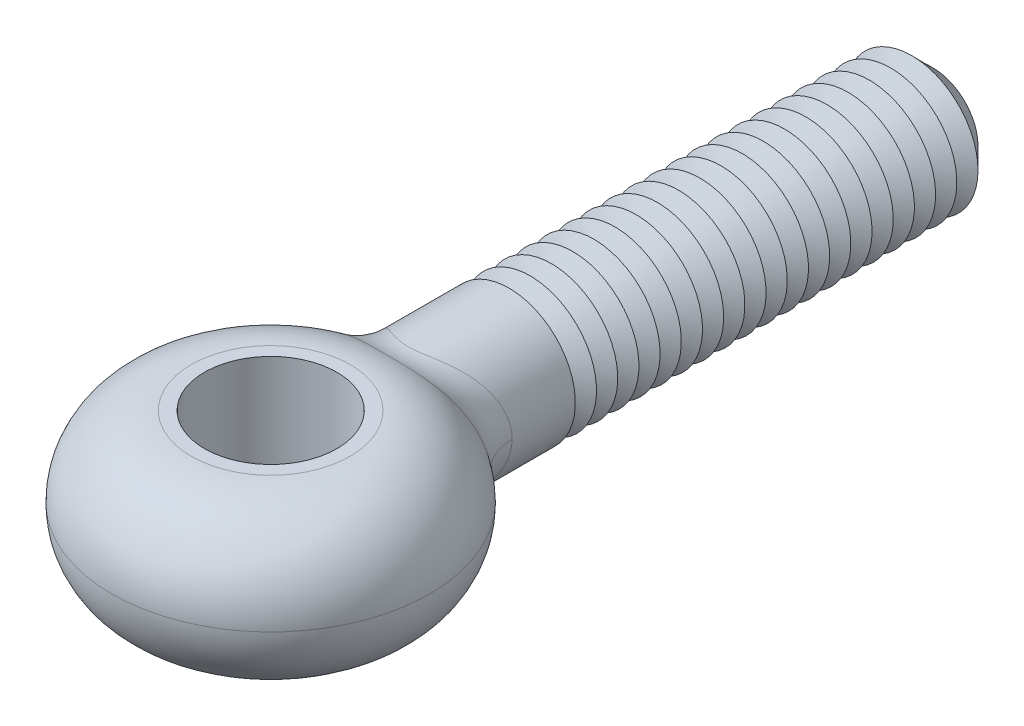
ISO-10303-21;
HEADER;
FILE_DESCRIPTION(('STEP AP214'),'2;1');
FILE_NAME('part.step','',(''),(''),'','','');
FILE_SCHEMA(('AUTOMOTIVE_DESIGN { 1 0 10303 214 1 1 1 1 }'));
ENDSEC;
DATA;
#1=APPLICATION_CONTEXT('core data for automotive mechanical design processes');
#2=APPLICATION_PROTOCOL_DEFINITION('international standard','automotive_design',2000,#1);
#3=PRODUCT_CONTEXT('',#1,'mechanical');
#4=PRODUCT('Part','Part','',(#3));
#5=PRODUCT_RELATED_PRODUCT_CATEGORY('part','',(#4));
#6=PRODUCT_DEFINITION_FORMATION('','',#4);
#7=PRODUCT_DEFINITION_CONTEXT('part definition',#1,'design');
#8=PRODUCT_DEFINITION('design','',#6,#7);
#9=PRODUCT_DEFINITION_SHAPE('','',#8);
#10=(LENGTH_UNIT() NAMED_UNIT(*) SI_UNIT(.MILLI.,.METRE.));
#11=(NAMED_UNIT(*) PLANE_ANGLE_UNIT() SI_UNIT($,.RADIAN.));
#12=(NAMED_UNIT(*) SI_UNIT($,.STERADIAN.) SOLID_ANGLE_UNIT());
#13=UNCERTAINTY_MEASURE_WITH_UNIT(LENGTH_MEASURE(1.E-05),#10,'distance_accuracy_value','');
#14=(GEOMETRIC_REPRESENTATION_CONTEXT(3) GLOBAL_UNCERTAINTY_ASSIGNED_CONTEXT((#13)) GLOBAL_UNIT_ASSIGNED_CONTEXT((#10,
#11,#12)) REPRESENTATION_CONTEXT('',''));
#15=CARTESIAN_POINT('',(0.,0.,0.));
#16=DIRECTION('',(0.,0.,1.));
#17=DIRECTION('',(1.,0.,0.));
#18=AXIS2_PLACEMENT_3D('',#15,#16,#17);
#19=CARTESIAN_POINT('',(0.,0.,-25.));
#20=DIRECTION('',(0.,0.,1.));
#21=DIRECTION('',(1.,0.,0.));
#22=AXIS2_PLACEMENT_3D('',#19,#20,#21);
#23=CYLINDRICAL_SURFACE('',#22,2.5);
#24=CARTESIAN_POINT('',(0.,0.,-8.99999999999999));
#25=DIRECTION('',(0.,0.,-1.));
#26=DIRECTION('',(-1.,0.,0.));
#27=AXIS2_PLACEMENT_3D('',#24,#25,#26);
#28=CIRCLE('',#27,2.5);
#29=CARTESIAN_POINT('',(-2.5,0.,-8.99999999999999));
#30=VERTEX_POINT('',#29);
#31=EDGE_CURVE('E78',#30,#30,#28,.T.);
#32=ORIENTED_EDGE('',*,*,#31,.F.);
#33=EDGE_LOOP('',(#32));
#34=FACE_BOUND('',#33,.T.);
#35=CARTESIAN_POINT('',(2.78341953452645,-1.59186120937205,-4.79327924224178));
#36=CARTESIAN_POINT('',(2.14571805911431,-1.30072530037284,-5.3743447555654));
#37=CARTESIAN_POINT('',(2.01927820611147,-1.47394556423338,-6.25925612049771));
#38=CARTESIAN_POINT('',(2.831703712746,-1.53469920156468,-4.80662089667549));
#39=CARTESIAN_POINT('',(2.1772769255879,-1.24792172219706,-5.3898625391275));
#40=CARTESIAN_POINT('',(2.05791099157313,-1.42101777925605,-6.2878456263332));
#41=CARTESIAN_POINT('',(2.87731821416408,-1.47574824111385,-4.81931887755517));
#42=CARTESIAN_POINT('',(2.20644442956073,-1.19462176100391,-5.40436026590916));
#43=CARTESIAN_POINT('',(2.09456285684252,-1.36643355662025,-6.31497994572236));
#44=CARTESIAN_POINT('',(2.96300366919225,-1.35453728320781,-4.8433013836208));
#45=CARTESIAN_POINT('',(2.26036740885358,-1.08700563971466,-5.43139492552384));
#46=CARTESIAN_POINT('',(2.16363788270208,-1.25420118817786,-6.36611531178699));
#47=CARTESIAN_POINT('',(3.00307308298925,-1.29227637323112,-4.85458551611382));
#48=CARTESIAN_POINT('',(2.28509247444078,-1.0327073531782,-5.44391770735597));
#49=CARTESIAN_POINT('',(2.19605986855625,-1.19655219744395,-6.39011548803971));
#50=CARTESIAN_POINT('',(3.11457798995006,-1.10105207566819,-4.88610560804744));
#51=CARTESIAN_POINT('',(2.35298983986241,-0.868493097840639,-5.47855834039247));
#52=CARTESIAN_POINT('',(2.28651645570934,-1.0194926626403,-6.45703286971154));
#53=CARTESIAN_POINT('',(3.17736416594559,-0.967583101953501,-4.90402434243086));
#54=CARTESIAN_POINT('',(2.38951585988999,-0.757939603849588,-5.49756398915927));
#55=CARTESIAN_POINT('',(2.33778513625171,-0.895910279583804,-6.49489913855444));
#56=CARTESIAN_POINT('',(3.2762931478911,-0.696845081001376,-4.93234966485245));
#57=CARTESIAN_POINT('',(2.44601304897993,-0.539370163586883,-5.52722187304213));
#58=CARTESIAN_POINT('',(2.41878010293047,-0.64522692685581,-6.55463771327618));
#59=CARTESIAN_POINT('',(3.31322228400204,-0.559833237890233,-4.94297774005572));
#60=CARTESIAN_POINT('',(2.46634024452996,-0.431613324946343,-5.53805203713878));
#61=CARTESIAN_POINT('',(2.44914166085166,-0.518364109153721,-6.57698187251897));
#62=CARTESIAN_POINT('',(3.36256644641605,-0.281879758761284,-4.95719210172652));
#63=CARTESIAN_POINT('',(2.49336316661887,-0.215769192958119,-5.55249569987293));
#64=CARTESIAN_POINT('',(2.48974403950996,-0.260999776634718,-6.60684652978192));
#65=CARTESIAN_POINT('',(3.37499961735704,-0.140941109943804,-4.96078360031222));
#66=CARTESIAN_POINT('',(2.49999900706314,-0.107956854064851,-5.55607731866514));
#67=CARTESIAN_POINT('',(2.49999975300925,-0.130501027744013,-6.61437799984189));
#68=CARTESIAN_POINT('',(3.37500038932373,0.143401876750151,-4.96078381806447));
#69=CARTESIAN_POINT('',(2.50000101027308,0.109841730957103,-5.55607819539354));
#70=CARTESIAN_POINT('',(2.50000025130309,0.132779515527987,-6.61437856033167));
#71=CARTESIAN_POINT('',(3.36213005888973,0.286806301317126,-4.9570660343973));
#72=CARTESIAN_POINT('',(2.49313362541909,0.21953405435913,-5.55237139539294));
#73=CARTESIAN_POINT('',(2.48938379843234,0.265561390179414,-6.60658237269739));
#74=CARTESIAN_POINT('',(3.31105376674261,0.569447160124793,-4.94235345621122));
#75=CARTESIAN_POINT('',(2.4651455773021,0.439127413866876,-5.53741516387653));
#76=CARTESIAN_POINT('',(2.44735853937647,0.527265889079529,-6.57566949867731));
#77=CARTESIAN_POINT('',(3.2728375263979,0.708681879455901,-4.93135570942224));
#78=CARTESIAN_POINT('',(2.44409422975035,0.548739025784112,-5.52620260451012));
#79=CARTESIAN_POINT('',(2.41594129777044,0.656186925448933,-6.55254659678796));
#80=CARTESIAN_POINT('',(3.17230532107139,0.978796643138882,-4.90258103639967));
#81=CARTESIAN_POINT('',(2.3865722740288,0.767190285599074,-5.4960319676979));
#82=CARTESIAN_POINT('',(2.33365404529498,0.906293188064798,-6.49184951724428));
#83=CARTESIAN_POINT('',(3.11002745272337,1.10968951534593,-4.88481482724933));
#84=CARTESIAN_POINT('',(2.35027184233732,0.875780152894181,-5.47716086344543));
#85=CARTESIAN_POINT('',(2.28281478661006,1.02749029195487,-6.45429818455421));
#86=CARTESIAN_POINT('',(2.96306047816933,1.36001779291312,-4.84327946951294));
#87=CARTESIAN_POINT('',(2.26083780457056,1.09062442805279,-5.43155444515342));
#88=CARTESIAN_POINT('',(2.163610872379,1.25927573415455,-6.36610676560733));
#89=CARTESIAN_POINT('',(2.87837355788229,1.47945431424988,-4.81951090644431));
#90=CARTESIAN_POINT('',(2.20790880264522,1.19669657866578,-5.40491826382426));
#91=CARTESIAN_POINT('',(2.0952479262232,1.36986510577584,-6.31546795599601));
#92=CARTESIAN_POINT('',(2.68558517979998,1.7076778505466,-4.76625186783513));
#93=CARTESIAN_POINT('',(2.08220250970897,1.40697007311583,-5.34311996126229));
#94=CARTESIAN_POINT('',(1.94100402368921,1.58118319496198,-6.20133915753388));
#95=CARTESIAN_POINT('',(2.57685139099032,1.8160319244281,-4.73660969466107));
#96=CARTESIAN_POINT('',(2.00910730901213,1.51094837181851,-5.30782806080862));
#97=CARTESIAN_POINT('',(1.85465458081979,1.68151104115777,-6.13750593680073));
#98=CARTESIAN_POINT('',(2.33928032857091,2.01584554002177,-4.67361867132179));
#99=CARTESIAN_POINT('',(1.84304754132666,1.71007551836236,-5.23013197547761));
#100=CARTESIAN_POINT('',(1.66833418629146,1.86652364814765,-6.00086530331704));
#101=CARTESIAN_POINT('',(2.21043096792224,2.10729485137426,-4.64026759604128));
#102=CARTESIAN_POINT('',(1.75031966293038,1.8052391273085,-5.18781856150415));
#103=CARTESIAN_POINT('',(1.56835504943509,1.95119893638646,-5.92805250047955));
#104=CARTESIAN_POINT('',(1.99751216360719,2.23394098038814,-4.58780602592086));
#105=CARTESIAN_POINT('',(1.59194994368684,1.94203878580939,-5.11897301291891));
#106=CARTESIAN_POINT('',(1.4058468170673,2.06846387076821,-5.81257645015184));
#107=CARTESIAN_POINT('',(1.92009823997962,2.2756671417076,-4.56919966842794));
#108=CARTESIAN_POINT('',(1.5336987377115,1.98802800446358,-5.09422592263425));
#109=CARTESIAN_POINT('',(1.34723871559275,2.10709920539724,-5.77144648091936));
#110=CARTESIAN_POINT('',(1.75973784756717,2.35363226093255,-4.53203912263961));
#111=CARTESIAN_POINT('',(1.41145270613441,2.0755845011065,-5.04404873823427));
#112=CARTESIAN_POINT('',(1.22703303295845,2.17928913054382,-5.68893121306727));
#113=CARTESIAN_POINT('',(1.6767929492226,2.38987276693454,-4.51348492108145));
#114=CARTESIAN_POINT('',(1.3474791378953,2.11718338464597,-5.01861818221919));
#115=CARTESIAN_POINT('',(1.16543630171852,2.21284515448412,-5.6475459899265));
#116=CARTESIAN_POINT('',(1.5051830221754,2.45675134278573,-4.47701205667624));
#117=CARTESIAN_POINT('',(1.21372799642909,2.19531106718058,-4.96793801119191));
#118=CARTESIAN_POINT('',(1.03940209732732,2.27476976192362,-5.5658219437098));
#119=CARTESIAN_POINT('',(1.41651302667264,2.48738445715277,-4.45909396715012));
#120=CARTESIAN_POINT('',(1.14395137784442,2.23187357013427,-4.94267911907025));
#121=CARTESIAN_POINT('',(0.974962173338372,2.30313375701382,-5.52548407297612));
#122=CARTESIAN_POINT('',(1.2334267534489,2.54282715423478,-4.4247261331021));
#123=CARTESIAN_POINT('',(0.998757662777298,2.29910433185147,-4.89365860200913));
#124=CARTESIAN_POINT('',(0.843479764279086,2.35446958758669,-5.44777655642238));
#125=CARTESIAN_POINT('',(1.13901258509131,2.56763885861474,-4.40827585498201));
#126=CARTESIAN_POINT('',(0.923330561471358,2.32981830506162,-4.86987717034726));
#127=CARTESIAN_POINT('',(0.77643823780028,2.37744338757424,-5.41040583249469));
#128=CARTESIAN_POINT('',(0.906301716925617,2.6196969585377,-4.37198138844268));
#129=CARTESIAN_POINT('',(0.736578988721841,2.39507218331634,-4.81694956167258));
#130=CARTESIAN_POINT('',(0.613199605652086,2.42564533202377,-5.32763271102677));
#131=CARTESIAN_POINT('',(0.765194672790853,2.6441512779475,-4.35329767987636));
#132=CARTESIAN_POINT('',(0.622406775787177,2.42664265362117,-4.78918338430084));
#133=CARTESIAN_POINT('',(0.515784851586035,2.44828822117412,-5.28474181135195));
#134=CARTESIAN_POINT('',(0.546606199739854,2.67131287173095,-4.33168473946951));
#135=CARTESIAN_POINT('',(0.444918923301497,2.46206701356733,-4.756847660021));
#136=CARTESIAN_POINT('',(0.366917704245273,2.47343784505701,-5.23496757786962));
#137=CARTESIAN_POINT('',(0.472728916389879,2.67877512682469,-4.3255545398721));
#138=CARTESIAN_POINT('',(0.384868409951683,2.47188464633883,-4.74762646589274));
#139=CARTESIAN_POINT('',(0.316930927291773,2.4803473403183,-5.22081573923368));
#140=CARTESIAN_POINT('',(0.323225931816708,2.69043587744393,-4.31584469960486));
#141=CARTESIAN_POINT('',(0.263268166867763,2.48727604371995,-4.7329952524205));
#142=CARTESIAN_POINT('',(0.21623936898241,2.49114433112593,-5.19837742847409));
#143=CARTESIAN_POINT('',(0.24760125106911,2.69463623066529,-4.31226360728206));
#144=CARTESIAN_POINT('',(0.201683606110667,2.49286186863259,-4.72757415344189));
#145=CARTESIAN_POINT('',(0.165535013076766,2.49503354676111,-5.19008761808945));
#146=CARTESIAN_POINT('',(0.094861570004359,2.69970310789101,-4.30793149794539));
#147=CARTESIAN_POINT('',(0.0772955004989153,2.49960079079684,-4.72101731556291));
#148=CARTESIAN_POINT('',(0.0633454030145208,2.49972510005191,-5.18005710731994));
#149=CARTESIAN_POINT('',(0.017739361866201,2.70054092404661,-4.30720485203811));
#150=CARTESIAN_POINT('',(0.0144434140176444,2.50072036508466,-4.71991397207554));
#151=CARTESIAN_POINT('',(0.0118571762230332,2.500500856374,-5.17837280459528));
#152=CARTESIAN_POINT('',(-0.136203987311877,2.69878264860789,-4.30871632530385));
#153=CARTESIAN_POINT('',(-0.110955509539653,2.49837825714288,-4.72220376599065));
#154=CARTESIAN_POINT('',(-0.0909950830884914,2.49887282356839,-5.18187386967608));
#155=CARTESIAN_POINT('',(-0.213025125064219,2.69618651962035,-4.31095447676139));
#156=CARTESIAN_POINT('',(-0.173546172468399,2.49491488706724,-4.72559855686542));
#157=CARTESIAN_POINT('',(-0.142359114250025,2.49646899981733,-5.18705931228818));
#158=CARTESIAN_POINT('',(-0.36553597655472,2.68761038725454,-4.31820554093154));
#159=CARTESIAN_POINT('',(-0.297684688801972,2.48354513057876,-4.73655288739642));
#160=CARTESIAN_POINT('',(-0.244685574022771,2.48852813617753,-5.20383450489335));
#161=CARTESIAN_POINT('',(-0.441220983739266,2.6816189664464,-4.32322781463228));
#162=CARTESIAN_POINT('',(-0.359268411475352,2.47561613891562,-4.74413371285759));
#163=CARTESIAN_POINT('',(-0.295646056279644,2.48298052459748,-5.21544586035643));
#164=CARTESIAN_POINT('',(-0.590415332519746,2.6663656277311,-4.33565461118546));
#165=CARTESIAN_POINT('',(-0.480475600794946,2.4556075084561,-4.76278791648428));
#166=CARTESIAN_POINT('',(-0.396672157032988,2.46885706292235,-5.24411576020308));
#167=CARTESIAN_POINT('',(-0.663923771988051,2.65710237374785,-4.34306010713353));
#168=CARTESIAN_POINT('',(-0.540131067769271,2.44351406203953,-4.77387344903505));
#169=CARTESIAN_POINT('',(-0.44673740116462,2.46027997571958,-5.26117652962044));
#170=CARTESIAN_POINT('',(-0.831352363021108,2.63198098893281,-4.36244332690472));
#171=CARTESIAN_POINT('',(-0.675735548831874,2.41105829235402,-4.80270108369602));
#172=CARTESIAN_POINT('',(-0.561587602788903,2.43701943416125,-5.30571455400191));
#173=CARTESIAN_POINT('',(-0.924289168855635,2.6149613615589,-4.37512591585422));
#174=CARTESIAN_POINT('',(-0.750790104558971,2.38927243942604,-4.82144973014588));
#175=CARTESIAN_POINT('',(-0.625964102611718,2.42126052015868,-5.33477828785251));
#176=CARTESIAN_POINT('',(-1.10516352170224,2.57574008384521,-4.40274397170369));
#177=CARTESIAN_POINT('',(-0.89617727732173,2.33992937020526,-4.86182815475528));
#178=CARTESIAN_POINT('',(-0.752583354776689,2.38494452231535,-5.39780912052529));
#179=CARTESIAN_POINT('',(-1.19309918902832,2.55353650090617,-4.41768027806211));
#180=CARTESIAN_POINT('',(-0.966539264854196,2.31233373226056,-4.88348226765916));
#181=CARTESIAN_POINT('',(-0.814825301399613,2.36438564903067,-5.43177804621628));
#182=CARTESIAN_POINT('',(-1.36408592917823,2.50411967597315,-4.44895154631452));
#183=CARTESIAN_POINT('',(-1.10247087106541,2.25205127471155,-4.92826951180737));
#184=CARTESIAN_POINT('',(-0.937136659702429,2.31862932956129,-5.50258991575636));
#185=CARTESIAN_POINT('',(-1.4471314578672,2.47690088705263,-4.46528804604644));
#186=CARTESIAN_POINT('',(-1.16804717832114,2.21932398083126,-4.95142074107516));
#187=CARTESIAN_POINT('',(-0.997203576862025,2.29342674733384,-5.53943601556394));
#188=CARTESIAN_POINT('',(-1.60835015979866,2.41761835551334,-4.49866880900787));
#189=CARTESIAN_POINT('',(-1.29428986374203,2.14941948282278,-4.99811371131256));
#190=CARTESIAN_POINT('',(-1.11497966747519,2.23853551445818,-5.61439808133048));
#191=CARTESIAN_POINT('',(-1.68652398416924,2.38555526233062,-4.51571297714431));
#192=CARTESIAN_POINT('',(-1.3549551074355,2.11221158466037,-5.02166467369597));
#193=CARTESIAN_POINT('',(-1.17268915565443,2.20884746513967,-5.65251387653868));
#194=CARTESIAN_POINT('',(-1.84102679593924,2.31537342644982,-4.55065121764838));
#195=CARTESIAN_POINT('',(-1.47363936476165,2.03237790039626,-5.06928809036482));
#196=CARTESIAN_POINT('',(-1.28777958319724,2.1438642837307,-5.73031643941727));
#197=CARTESIAN_POINT('',(-1.91717041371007,2.27706976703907,-4.56855283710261));
#198=CARTESIAN_POINT('',(-1.5314431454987,1.98957796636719,-5.09334433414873));
#199=CARTESIAN_POINT('',(-1.34506326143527,2.10839793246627,-5.77000745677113));
#200=CARTESIAN_POINT('',(-2.06435914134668,2.19549414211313,-4.60411592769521));
#201=CARTESIAN_POINT('',(-1.64179513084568,1.90033354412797,-5.14043913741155));
#202=CARTESIAN_POINT('',(-1.45671149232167,2.03286494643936,-5.84853073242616));
#203=CARTESIAN_POINT('',(-2.13540269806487,2.15222067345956,-4.62177732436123));
#204=CARTESIAN_POINT('',(-1.69431856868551,1.85386594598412,-5.16347382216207));
#205=CARTESIAN_POINT('',(-1.51107515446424,1.99279691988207,-5.88736272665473));
#206=CARTESIAN_POINT('',(-2.34062893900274,2.01525525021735,-4.67380595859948));
#207=CARTESIAN_POINT('',(-1.84426716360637,1.70956328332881,-5.23047721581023));
#208=CARTESIAN_POINT('',(-1.66923732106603,1.86597708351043,-6.00131438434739));
#209=CARTESIAN_POINT('',(-2.46717911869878,1.91429396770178,-4.70728175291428));
#210=CARTESIAN_POINT('',(-1.93332878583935,1.60734351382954,-5.27203498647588));
#211=CARTESIAN_POINT('',(-1.76831121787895,1.7724944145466,-6.07403221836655));
#212=CARTESIAN_POINT('',(-2.70679041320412,1.68661240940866,-4.77193962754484));
#213=CARTESIAN_POINT('',(-2.09686028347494,1.38674049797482,-5.35007469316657));
#214=CARTESIAN_POINT('',(-1.95773190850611,1.56167815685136,-6.21363092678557));
#215=CARTESIAN_POINT('',(-2.81813452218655,1.55853025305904,-4.80276284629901));
#216=CARTESIAN_POINT('',(-2.16933176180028,1.26784061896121,-5.38577211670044));
#217=CARTESIAN_POINT('',(-2.04687161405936,1.44308356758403,-6.27966835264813));
#218=CARTESIAN_POINT('',(-3.01261219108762,1.28525500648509,-4.85717783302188));
#219=CARTESIAN_POINT('',(-2.29190513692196,1.02488048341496,-5.44718873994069));
#220=CARTESIAN_POINT('',(-2.20361102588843,1.19005093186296,-6.39571302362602));
#221=CARTESIAN_POINT('',(-3.09572994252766,1.14005238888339,-4.8807655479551));
#222=CARTESIAN_POINT('',(-2.34165620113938,0.901027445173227,-5.47274428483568));
#223=CARTESIAN_POINT('',(-2.27119866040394,1.05560406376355,-6.44571128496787));
#224=CARTESIAN_POINT('',(-3.22543031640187,0.849553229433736,-4.91775305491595));
#225=CARTESIAN_POINT('',(-2.41740189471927,0.661472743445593,-5.51211129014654));
#226=CARTESIAN_POINT('',(-2.37706331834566,0.786623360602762,-6.5238938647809));
#227=CARTESIAN_POINT('',(-3.27441877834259,0.705208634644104,-4.93182105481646));
#228=CARTESIAN_POINT('',(-2.44479989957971,0.546140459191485,-5.52660885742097));
#229=CARTESIAN_POINT('',(-2.41726455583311,0.652970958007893,-6.55351221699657));
#230=CARTESIAN_POINT('',(-3.3444386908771,0.410725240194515,-4.95196114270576));
#231=CARTESIAN_POINT('',(-2.48358904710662,0.315091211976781,-5.54724099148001));
#232=CARTESIAN_POINT('',(-2.47480549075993,0.380301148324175,-6.59586878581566));
#233=CARTESIAN_POINT('',(-3.365557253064,0.260606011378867,-4.95805814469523));
#234=CARTESIAN_POINT('',(-2.49491680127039,0.199701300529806,-5.55334192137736));
#235=CARTESIAN_POINT('',(-2.49221642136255,0.241301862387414,-6.6086595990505));
#236=CARTESIAN_POINT('',(-3.3741611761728,0.0734663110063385,-4.96054177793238));
#237=CARTESIAN_POINT('',(-2.49954473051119,0.0562665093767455,-5.55583336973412));
#238=CARTESIAN_POINT('',(-2.49930902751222,0.06802436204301,-6.61387040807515));
#239=CARTESIAN_POINT('',(-3.37500321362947,0.0367413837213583,-4.9607847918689));
#240=CARTESIAN_POINT('',(-2.49999869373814,0.0281412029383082,-5.55607760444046));
#241=CARTESIAN_POINT('',(-2.50000304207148,0.0340197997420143,-6.61438032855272));
#242=CARTESIAN_POINT('',(-3.37498749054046,-0.143020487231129,-4.9607794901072));
#243=CARTESIAN_POINT('',(-2.50000508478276,-0.109543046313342,-5.55607833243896));
#244=CARTESIAN_POINT('',(-2.49998815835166,-0.132426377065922,-6.61437029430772));
#245=CARTESIAN_POINT('',(-3.36216727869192,-0.286290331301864,-4.9570765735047));
#246=CARTESIAN_POINT('',(-2.49315564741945,-0.219138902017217,-5.55238275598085));
#247=CARTESIAN_POINT('',(-2.48941413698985,-0.265083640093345,-6.60660464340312));
#248=CARTESIAN_POINT('',(-3.31118832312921,-0.5690125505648,-4.94239239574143));
#249=CARTESIAN_POINT('',(-2.46521750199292,-0.438784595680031,-5.53745400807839));
#250=CARTESIAN_POINT('',(-2.44746953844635,-0.526863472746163,-6.57575118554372));
#251=CARTESIAN_POINT('',(-3.2729343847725,-0.708448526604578,-4.93138379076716));
#252=CARTESIAN_POINT('',(-2.44415038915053,-0.548545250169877,-5.5262324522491));
#253=CARTESIAN_POINT('',(-2.41602083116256,-0.65597085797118,-6.55260581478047));
#254=CARTESIAN_POINT('',(-3.172210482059,-0.979024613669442,-4.90255353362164));
#255=CARTESIAN_POINT('',(-2.38651784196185,-0.767377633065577,-5.49600302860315));
#256=CARTESIAN_POINT('',(-2.3335761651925,-0.906504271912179,-6.49179151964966));
#257=CARTESIAN_POINT('',(-3.10977969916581,-1.11017775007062,-4.88474290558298));
#258=CARTESIAN_POINT('',(-2.35012430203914,-0.876197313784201,-5.47708301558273));
#259=CARTESIAN_POINT('',(-2.28261183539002,-1.0279423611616,-6.45414609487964));
#260=CARTESIAN_POINT('',(-2.99946679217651,-1.29797370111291,-4.85356946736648));
#261=CARTESIAN_POINT('',(-2.28287045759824,-1.0376648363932,-5.44279118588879));
#262=CARTESIAN_POINT('',(-2.19314078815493,-1.2018275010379,-6.3879550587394));
#263=CARTESIAN_POINT('',(-2.95997615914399,-1.35901454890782,-4.84245162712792));
#264=CARTESIAN_POINT('',(-2.25847709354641,-1.0909506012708,-5.43044281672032));
#265=CARTESIAN_POINT('',(-2.16119309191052,-1.25834680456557,-6.36430554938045));
#266=CARTESIAN_POINT('',(-2.87565347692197,-1.4778979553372,-4.81885538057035));
#267=CARTESIAN_POINT('',(-2.20537734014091,-1.19657026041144,-5.40382980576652));
#268=CARTESIAN_POINT('',(-2.09322519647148,-1.36842403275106,-6.31398947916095));
#269=CARTESIAN_POINT('',(-2.83082295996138,-1.53574142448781,-4.8063773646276));
#270=CARTESIAN_POINT('',(-2.17669982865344,-1.24888735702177,-5.38957859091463));
#271=CARTESIAN_POINT('',(-2.05720616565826,-1.42198280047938,-6.2873237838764));
#272=CARTESIAN_POINT('',(-2.78341953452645,-1.59186120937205,-4.79327924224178));
#273=CARTESIAN_POINT('',(-2.14571805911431,-1.30072530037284,-5.3743447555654));
#274=CARTESIAN_POINT('',(-2.01927820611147,-1.47394556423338,-6.25925612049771));
#275=(BOUNDED_SURFACE() B_SPLINE_SURFACE(3,2,((#35,#36,#37),(#38,#39,#40),(#41,#42,#43),(#44,
#45,#46),(#47,#48,#49),(#50,#51,#52),(#53,#54,#55),(#56,#57,#58),(#59,#60,#61),(#62,#63,#64),
(#65,#66,#67),(#68,#69,#70),(#71,#72,#73),(#74,#75,#76),(#77,#78,#79),(#80,#81,#82),(#83,#84,
#85),(#86,#87,#88),(#89,#90,#91),(#92,#93,#94),(#95,#96,#97),(#98,#99,#100),(#101,#102,#103),
(#104,#105,#106),(#107,#108,#109),(#110,#111,#112),(#113,#114,#115),(#116,#117,#118),(#119,#120,
#121),(#122,#123,#124),(#125,#126,#127),(#128,#129,#130),(#131,#132,#133),(#134,#135,#136),
(#137,#138,#139),(#140,#141,#142),(#143,#144,#145),(#146,#147,#148),(#149,#150,#151),(#152,#153,
#154),(#155,#156,#157),(#158,#159,#160),(#161,#162,#163),(#164,#165,#166),(#167,#168,#169),
(#170,#171,#172),(#173,#174,#175),(#176,#177,#178),(#179,#180,#181),(#182,#183,#184),(#185,#186,
#187),(#188,#189,#190),(#191,#192,#193),(#194,#195,#196),(#197,#198,#199),(#200,#201,#202),
(#203,#204,#205),(#206,#207,#208),(#209,#210,#211),(#212,#213,#214),(#215,#216,#217),(#218,#219,
#220),(#221,#222,#223),(#224,#225,#226),(#227,#228,#229),(#230,#231,#232),(#233,#234,#235),
(#236,#237,#238),(#239,#240,#241),(#242,#243,#244),(#245,#246,#247),(#248,#249,#250),(#251,#252,
#253),(#254,#255,#256),(#257,#258,#259),(#260,#261,#262),(#263,#264,#265),(#266,#267,#268),
(#269,#270,#271),(#272,#273,#274)),.UNSPECIFIED.,.F.,.F.,.F.) B_SPLINE_SURFACE_WITH_KNOTS((4,2,
2,2,2,2,2,2,2,2,2,2,2,2,2,2,2,2,2,2,2,2,2,2,2,2,2,2,2,2,2,2,2,2,2,2,2,2,2,4),(3,3),(0.,
0.363898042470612,0.727896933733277,1.45549120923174,2.15986563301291,2.86371811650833,
3.57985953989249,4.2962915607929,5.01159387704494,5.72682644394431,6.46375484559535,
7.20112776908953,7.5994115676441,7.99758275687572,8.39610414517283,8.79448006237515,
9.34746095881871,9.62295413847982,9.89829030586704,10.175972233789,10.4536571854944,
10.7322815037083,11.0110197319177,11.3788266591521,11.7467709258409,12.1151246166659,
12.4834289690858,12.8658412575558,13.2483695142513,14.0121043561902,14.8329658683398,
15.6542863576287,16.4093703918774,17.1620886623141,17.3457541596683,18.060695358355,
18.7783276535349,19.4948017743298,19.8521704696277,20.2094368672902),(0.,1.),
.UNSPECIFIED.) GEOMETRIC_REPRESENTATION_ITEM() RATIONAL_B_SPLINE_SURFACE(((1.,0.91012003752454,
1.),(1.,0.908112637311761,1.),(1.,0.906182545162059,1.),(1.,0.902507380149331,1.),(1.,
0.900762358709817,1.),(1.,0.895853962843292,1.),(1.,0.8930149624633,1.),(1.,0.888491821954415,
1.),(1.,0.886773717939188,1.),(1.,0.884469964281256,1.),(1.,0.883883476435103,1.),(1.,
0.883883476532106,1.),(1.,0.884490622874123,1.),(1.,0.886874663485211,1.),(1.,0.888652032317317,
1.),(1.,0.893243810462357,1.),(1.,0.896056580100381,1.),(1.,0.902521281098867,1.),(1.,
0.906173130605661,1.),(1.,0.914186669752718,1.),(1.,0.918566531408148,1.),(1.,0.927642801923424,
1.),(1.,0.932339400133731,1.),(1.,0.939527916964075,1.),(1.,0.942040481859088,1.),(1.,
0.946983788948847,1.),(1.,0.949414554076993,1.),(1.,0.954120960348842,1.),(1.,0.95639646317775,
1.),(1.,0.960697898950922,1.),(1.,0.962723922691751,1.),(1.,0.967135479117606,1.),(1.,
0.969355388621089,1.),(1.,0.971895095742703,1.),(1.,0.972609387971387,1.),(1.,0.973736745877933,
1.),(1.,0.974149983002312,1.),(1.,0.974649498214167,1.),(1.,0.974732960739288,1.),(1.,
0.974558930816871,1.),(1.,0.974301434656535,1.),(1.,0.973462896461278,1.),(1.,0.972880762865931,
1.),(1.,0.971429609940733,1.),(1.,0.970560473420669,1.),(1.,0.968264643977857,1.),(1.,
0.966748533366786,1.),(1.,0.963399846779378,1.),(1.,0.961567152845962,1.),(1.,0.957673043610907,
1.),(1.,0.955611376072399,1.),(1.,0.951336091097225,1.),(1.,0.949122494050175,1.),(1.,
0.944519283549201,1.),(1.,0.942126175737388,1.),(1.,0.937304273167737,1.),(1.,0.934875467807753,
1.),(1.,0.92762365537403,1.),(1.,0.922826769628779,1.),(1.,0.913355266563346,1.),(1.,
0.908716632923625,1.),(1.,0.900383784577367,1.),(1.,0.896690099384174,1.),(1.,0.890834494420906,
1.),(1.,0.888573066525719,1.),(1.,0.885321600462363,1.),(1.,0.88432760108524,1.),(1.,
0.883922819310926,1.),(1.,0.883883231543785,1.),(1.,0.883884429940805,1.),(1.,0.884488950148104,
1.),(1.,0.886868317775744,1.),(1.,0.88864756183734,1.),(1.,0.893248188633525,1.),(1.,
0.896067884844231,1.),(1.,0.900919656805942,1.),(1.,0.902638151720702,1.),(1.,0.906252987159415,
1.),(1.,0.908149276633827,1.),(1.,0.91012003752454,1.))) REPRESENTATION_ITEM('') SURFACE());
#276=CARTESIAN_POINT('',(-2.01927820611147,-1.47394556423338,-6.25925612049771));
#277=CARTESIAN_POINT('',(-2.05720616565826,-1.42198280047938,-6.2873237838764));
#278=CARTESIAN_POINT('',(-2.09322519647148,-1.36842403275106,-6.31398947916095));
#279=CARTESIAN_POINT('',(-2.16119309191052,-1.25834680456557,-6.36430554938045));
#280=CARTESIAN_POINT('',(-2.19314078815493,-1.2018275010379,-6.3879550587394));
#281=CARTESIAN_POINT('',(-2.28261183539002,-1.0279423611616,-6.45414609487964));
#282=CARTESIAN_POINT('',(-2.3335761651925,-0.906504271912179,-6.49179151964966));
#283=CARTESIAN_POINT('',(-2.41602083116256,-0.655970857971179,-6.55260581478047));
#284=CARTESIAN_POINT('',(-2.44746953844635,-0.526863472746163,-6.57575118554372));
#285=CARTESIAN_POINT('',(-2.48941413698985,-0.265083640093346,-6.60660464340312));
#286=CARTESIAN_POINT('',(-2.49998815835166,-0.132426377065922,-6.61437029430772));
#287=CARTESIAN_POINT('',(-2.50000304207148,0.0340197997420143,-6.61438032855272));
#288=CARTESIAN_POINT('',(-2.49930902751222,0.0680243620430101,-6.61387040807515));
#289=CARTESIAN_POINT('',(-2.49221642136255,0.241301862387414,-6.6086595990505));
#290=CARTESIAN_POINT('',(-2.47480549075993,0.380301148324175,-6.59586878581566));
#291=CARTESIAN_POINT('',(-2.41726455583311,0.652970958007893,-6.55351221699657));
#292=CARTESIAN_POINT('',(-2.37706331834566,0.786623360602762,-6.5238938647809));
#293=CARTESIAN_POINT('',(-2.27119866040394,1.05560406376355,-6.44571128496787));
#294=CARTESIAN_POINT('',(-2.20361102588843,1.19005093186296,-6.39571302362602));
#295=CARTESIAN_POINT('',(-2.04687161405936,1.44308356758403,-6.27966835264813));
#296=CARTESIAN_POINT('',(-1.95773190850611,1.56167815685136,-6.21363092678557));
#297=CARTESIAN_POINT('',(-1.76831121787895,1.7724944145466,-6.07403221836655));
#298=CARTESIAN_POINT('',(-1.66923732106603,1.86597708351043,-6.00131438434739));
#299=CARTESIAN_POINT('',(-1.51107515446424,1.99279691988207,-5.88736272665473));
#300=CARTESIAN_POINT('',(-1.45671149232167,2.03286494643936,-5.84853073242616));
#301=CARTESIAN_POINT('',(-1.34506326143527,2.10839793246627,-5.77000745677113));
#302=CARTESIAN_POINT('',(-1.28777958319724,2.1438642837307,-5.73031643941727));
#303=CARTESIAN_POINT('',(-1.17268915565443,2.20884746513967,-5.65251387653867));
#304=CARTESIAN_POINT('',(-1.11497966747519,2.23853551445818,-5.61439808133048));
#305=CARTESIAN_POINT('',(-0.997203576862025,2.29342674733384,-5.53943601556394));
#306=CARTESIAN_POINT('',(-0.937136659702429,2.31862932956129,-5.50258991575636));
#307=CARTESIAN_POINT('',(-0.814825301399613,2.36438564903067,-5.43177804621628));
#308=CARTESIAN_POINT('',(-0.752583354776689,2.38494452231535,-5.39780912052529));
#309=CARTESIAN_POINT('',(-0.625964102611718,2.42126052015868,-5.33477828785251));
#310=CARTESIAN_POINT('',(-0.561587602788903,2.43701943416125,-5.30571455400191));
#311=CARTESIAN_POINT('',(-0.44673740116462,2.46027997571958,-5.26117652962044));
#312=CARTESIAN_POINT('',(-0.396672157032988,2.46885706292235,-5.24411576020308));
#313=CARTESIAN_POINT('',(-0.295646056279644,2.48298052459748,-5.21544586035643));
#314=CARTESIAN_POINT('',(-0.244685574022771,2.48852813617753,-5.20383450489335));
#315=CARTESIAN_POINT('',(-0.142359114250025,2.49646899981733,-5.18705931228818));
#316=CARTESIAN_POINT('',(-0.0909950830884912,2.49887282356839,-5.18187386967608));
#317=CARTESIAN_POINT('',(0.0118571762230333,2.500500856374,-5.17837280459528));
#318=CARTESIAN_POINT('',(0.0633454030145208,2.49972510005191,-5.18005710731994));
#319=CARTESIAN_POINT('',(0.165535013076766,2.49503354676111,-5.19008761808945));
#320=CARTESIAN_POINT('',(0.21623936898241,2.49114433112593,-5.19837742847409));
#321=CARTESIAN_POINT('',(0.316930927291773,2.4803473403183,-5.22081573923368));
#322=CARTESIAN_POINT('',(0.366917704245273,2.47343784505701,-5.23496757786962));
#323=CARTESIAN_POINT('',(0.515784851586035,2.44828822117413,-5.28474181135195));
#324=CARTESIAN_POINT('',(0.613199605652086,2.42564533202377,-5.32763271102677));
#325=CARTESIAN_POINT('',(0.77643823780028,2.37744338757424,-5.41040583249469));
#326=CARTESIAN_POINT('',(0.843479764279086,2.35446958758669,-5.44777655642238));
#327=CARTESIAN_POINT('',(0.974962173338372,2.30313375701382,-5.52548407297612));
#328=CARTESIAN_POINT('',(1.03940209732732,2.27476976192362,-5.5658219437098));
#329=CARTESIAN_POINT('',(1.16543630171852,2.21284515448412,-5.6475459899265));
#330=CARTESIAN_POINT('',(1.22703303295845,2.17928913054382,-5.68893121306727));
#331=CARTESIAN_POINT('',(1.34723871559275,2.10709920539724,-5.77144648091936));
#332=CARTESIAN_POINT('',(1.4058468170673,2.06846387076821,-5.81257645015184));
#333=CARTESIAN_POINT('',(1.56835504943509,1.95119893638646,-5.92805250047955));
#334=CARTESIAN_POINT('',(1.66833418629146,1.86652364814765,-6.00086530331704));
#335=CARTESIAN_POINT('',(1.85465458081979,1.68151104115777,-6.13750593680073));
#336=CARTESIAN_POINT('',(1.94100402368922,1.58118319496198,-6.20133915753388));
#337=CARTESIAN_POINT('',(2.0952479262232,1.36986510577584,-6.31546795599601));
#338=CARTESIAN_POINT('',(2.163610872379,1.25927573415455,-6.36610676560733));
#339=CARTESIAN_POINT('',(2.28281478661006,1.02749029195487,-6.45429818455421));
#340=CARTESIAN_POINT('',(2.33365404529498,0.906293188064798,-6.49184951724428));
#341=CARTESIAN_POINT('',(2.41594129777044,0.656186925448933,-6.55254659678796));
#342=CARTESIAN_POINT('',(2.44735853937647,0.52726588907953,-6.57566949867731));
#343=CARTESIAN_POINT('',(2.48938379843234,0.265561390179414,-6.60658237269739));
#344=CARTESIAN_POINT('',(2.50000025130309,0.132779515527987,-6.61437856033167));
#345=CARTESIAN_POINT('',(2.49999975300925,-0.130501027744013,-6.61437799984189));
#346=CARTESIAN_POINT('',(2.48974403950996,-0.260999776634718,-6.60684652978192));
#347=CARTESIAN_POINT('',(2.44914166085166,-0.518364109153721,-6.57698187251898));
#348=CARTESIAN_POINT('',(2.41878010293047,-0.64522692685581,-6.55463771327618));
#349=CARTESIAN_POINT('',(2.33778513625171,-0.895910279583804,-6.49489913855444));
#350=CARTESIAN_POINT('',(2.28651645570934,-1.0194926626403,-6.45703286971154));
#351=CARTESIAN_POINT('',(2.19605986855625,-1.19655219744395,-6.39011548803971));
#352=CARTESIAN_POINT('',(2.16363788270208,-1.25420118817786,-6.36611531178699));
#353=CARTESIAN_POINT('',(2.09456285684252,-1.36643355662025,-6.31497994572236));
#354=CARTESIAN_POINT('',(2.05791099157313,-1.42101777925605,-6.2878456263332));
#355=CARTESIAN_POINT('',(2.01927820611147,-1.47394556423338,-6.25925612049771));
#356=B_SPLINE_CURVE_WITH_KNOTS('',3,(#276,#277,#278,#279,#280,#281,#282,#283,#284,#285,#286,
#287,#288,#289,#290,#291,#292,#293,#294,#295,#296,#297,#298,#299,#300,#301,#302,#303,#304,#305,
#306,#307,#308,#309,#310,#311,#312,#313,#314,#315,#316,#317,#318,#319,#320,#321,#322,#323,#324,
#325,#326,#327,#328,#329,#330,#331,#332,#333,#334,#335,#336,#337,#338,#339,#340,#341,#342,#343,
#344,#345,#346,#347,#348,#349,#350,#351,#352,#353,#354,#355),.UNSPECIFIED.,.F.,.F.,(4,2,2,2,2,2,
2,2,2,2,2,2,2,2,2,2,2,2,2,2,2,2,2,2,2,2,2,2,2,2,2,2,2,2,2,2,2,2,2,4),(0.,0.357266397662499,
0.714635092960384,1.43110921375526,2.14874150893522,2.86368270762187,3.04734820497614,
3.80006647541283,4.55515050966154,5.37647099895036,6.19733251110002,6.96106735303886,
7.34359560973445,7.7260078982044,8.09431225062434,8.46266594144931,8.83061020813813,
9.19841713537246,9.47715536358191,9.75577968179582,10.0334646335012,10.3111465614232,
10.5864827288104,10.8619759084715,11.4149568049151,11.8133327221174,12.2118541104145,
12.6100252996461,13.0083090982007,13.7456820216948,14.4826104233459,15.1978429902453,
15.9131453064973,16.6295773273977,17.3457187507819,18.0495712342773,18.7539456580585,
19.4815399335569,19.8455388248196,20.2094368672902),.UNSPECIFIED.);
#357=CARTESIAN_POINT('',(-2.5,0.,-6.61437827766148));
#358=VERTEX_POINT('',#357);
#359=CARTESIAN_POINT('',(2.5,0.,-6.61437827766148));
#360=VERTEX_POINT('',#359);
#361=EDGE_CURVE('E80',#358,#360,#356,.T.);
#362=ORIENTED_EDGE('',*,*,#361,.T.);
#363=CARTESIAN_POINT('',(-2.78341953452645,1.59186120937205,-4.79327924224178));
#364=CARTESIAN_POINT('',(-2.14571805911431,1.30072530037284,-5.3743447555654));
#365=CARTESIAN_POINT('',(-2.01927820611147,1.47394556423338,-6.25925612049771));
#366=CARTESIAN_POINT('',(-2.831703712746,1.53469920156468,-4.80662089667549));
#367=CARTESIAN_POINT('',(-2.1772769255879,1.24792172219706,-5.3898625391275));
#368=CARTESIAN_POINT('',(-2.05791099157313,1.42101777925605,-6.2878456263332));
#369=CARTESIAN_POINT('',(-2.87731821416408,1.47574824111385,-4.81931887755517));
#370=CARTESIAN_POINT('',(-2.20644442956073,1.19462176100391,-5.40436026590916));
#371=CARTESIAN_POINT('',(-2.09456285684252,1.36643355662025,-6.31497994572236));
#372=CARTESIAN_POINT('',(-2.96300366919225,1.35453728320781,-4.8433013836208));
#373=CARTESIAN_POINT('',(-2.26036740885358,1.08700563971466,-5.43139492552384));
#374=CARTESIAN_POINT('',(-2.16363788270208,1.25420118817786,-6.36611531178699));
#375=CARTESIAN_POINT('',(-3.00307308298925,1.29227637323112,-4.85458551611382));
#376=CARTESIAN_POINT('',(-2.28509247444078,1.0327073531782,-5.44391770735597));
#377=CARTESIAN_POINT('',(-2.19605986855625,1.19655219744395,-6.39011548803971));
#378=CARTESIAN_POINT('',(-3.11457798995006,1.10105207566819,-4.88610560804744));
#379=CARTESIAN_POINT('',(-2.35298983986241,0.868493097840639,-5.47855834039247));
#380=CARTESIAN_POINT('',(-2.28651645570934,1.0194926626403,-6.45703286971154));
#381=CARTESIAN_POINT('',(-3.17736416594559,0.967583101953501,-4.90402434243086));
#382=CARTESIAN_POINT('',(-2.38951585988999,0.757939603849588,-5.49756398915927));
#383=CARTESIAN_POINT('',(-2.33778513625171,0.895910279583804,-6.49489913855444));
#384=CARTESIAN_POINT('',(-3.2762931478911,0.696845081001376,-4.93234966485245));
#385=CARTESIAN_POINT('',(-2.44601304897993,0.539370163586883,-5.52722187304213));
#386=CARTESIAN_POINT('',(-2.41878010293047,0.64522692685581,-6.55463771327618));
#387=CARTESIAN_POINT('',(-3.31322228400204,0.559833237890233,-4.94297774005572));
#388=CARTESIAN_POINT('',(-2.46634024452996,0.431613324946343,-5.53805203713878));
#389=CARTESIAN_POINT('',(-2.44914166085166,0.518364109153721,-6.57698187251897));
#390=CARTESIAN_POINT('',(-3.36256644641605,0.281879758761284,-4.95719210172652));
#391=CARTESIAN_POINT('',(-2.49336316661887,0.215769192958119,-5.55249569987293));
#392=CARTESIAN_POINT('',(-2.48974403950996,0.260999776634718,-6.60684652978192));
#393=CARTESIAN_POINT('',(-3.37499961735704,0.140941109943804,-4.96078360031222));
#394=CARTESIAN_POINT('',(-2.49999900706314,0.107956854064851,-5.55607731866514));
#395=CARTESIAN_POINT('',(-2.49999975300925,0.130501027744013,-6.61437799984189));
#396=CARTESIAN_POINT('',(-3.37500038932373,-0.143401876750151,-4.96078381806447));
#397=CARTESIAN_POINT('',(-2.50000101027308,-0.109841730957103,-5.55607819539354));
#398=CARTESIAN_POINT('',(-2.50000025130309,-0.132779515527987,-6.61437856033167));
#399=CARTESIAN_POINT('',(-3.36213005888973,-0.286806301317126,-4.9570660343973));
#400=CARTESIAN_POINT('',(-2.49313362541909,-0.21953405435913,-5.55237139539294));
#401=CARTESIAN_POINT('',(-2.48938379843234,-0.265561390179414,-6.60658237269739));
#402=CARTESIAN_POINT('',(-3.31105376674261,-0.569447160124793,-4.94235345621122));
#403=CARTESIAN_POINT('',(-2.4651455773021,-0.439127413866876,-5.53741516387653));
#404=CARTESIAN_POINT('',(-2.44735853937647,-0.527265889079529,-6.57566949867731));
#405=CARTESIAN_POINT('',(-3.2728375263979,-0.708681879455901,-4.93135570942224));
#406=CARTESIAN_POINT('',(-2.44409422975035,-0.548739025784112,-5.52620260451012));
#407=CARTESIAN_POINT('',(-2.41594129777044,-0.656186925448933,-6.55254659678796));
#408=CARTESIAN_POINT('',(-3.17230532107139,-0.978796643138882,-4.90258103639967));
#409=CARTESIAN_POINT('',(-2.3865722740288,-0.767190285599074,-5.4960319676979));
#410=CARTESIAN_POINT('',(-2.33365404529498,-0.906293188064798,-6.49184951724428));
#411=CARTESIAN_POINT('',(-3.11002745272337,-1.10968951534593,-4.88481482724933));
#412=CARTESIAN_POINT('',(-2.35027184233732,-0.875780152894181,-5.47716086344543));
#413=CARTESIAN_POINT('',(-2.28281478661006,-1.02749029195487,-6.45429818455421));
#414=CARTESIAN_POINT('',(-2.96306047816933,-1.36001779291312,-4.84327946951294));
#415=CARTESIAN_POINT('',(-2.26083780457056,-1.09062442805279,-5.43155444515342));
#416=CARTESIAN_POINT('',(-2.163610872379,-1.25927573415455,-6.36610676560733));
#417=CARTESIAN_POINT('',(-2.87837355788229,-1.47945431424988,-4.81951090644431));
#418=CARTESIAN_POINT('',(-2.20790880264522,-1.19669657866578,-5.40491826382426));
#419=CARTESIAN_POINT('',(-2.0952479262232,-1.36986510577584,-6.31546795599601));
#420=CARTESIAN_POINT('',(-2.68558517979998,-1.7076778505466,-4.76625186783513));
#421=CARTESIAN_POINT('',(-2.08220250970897,-1.40697007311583,-5.34311996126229));
#422=CARTESIAN_POINT('',(-1.94100402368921,-1.58118319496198,-6.20133915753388));
#423=CARTESIAN_POINT('',(-2.57685139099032,-1.8160319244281,-4.73660969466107));
#424=CARTESIAN_POINT('',(-2.00910730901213,-1.51094837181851,-5.30782806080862));
#425=CARTESIAN_POINT('',(-1.85465458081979,-1.68151104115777,-6.13750593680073));
#426=CARTESIAN_POINT('',(-2.33928032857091,-2.01584554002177,-4.67361867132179));
#427=CARTESIAN_POINT('',(-1.84304754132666,-1.71007551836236,-5.23013197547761));
#428=CARTESIAN_POINT('',(-1.66833418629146,-1.86652364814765,-6.00086530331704));
#429=CARTESIAN_POINT('',(-2.21043096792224,-2.10729485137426,-4.64026759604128));
#430=CARTESIAN_POINT('',(-1.75031966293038,-1.8052391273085,-5.18781856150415));
#431=CARTESIAN_POINT('',(-1.56835504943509,-1.95119893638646,-5.92805250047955));
#432=CARTESIAN_POINT('',(-1.99751216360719,-2.23394098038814,-4.58780602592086));
#433=CARTESIAN_POINT('',(-1.59194994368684,-1.94203878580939,-5.11897301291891));
#434=CARTESIAN_POINT('',(-1.4058468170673,-2.06846387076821,-5.81257645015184));
#435=CARTESIAN_POINT('',(-1.92009823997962,-2.2756671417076,-4.56919966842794));
#436=CARTESIAN_POINT('',(-1.5336987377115,-1.98802800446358,-5.09422592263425));
#437=CARTESIAN_POINT('',(-1.34723871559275,-2.10709920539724,-5.77144648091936));
#438=CARTESIAN_POINT('',(-1.75973784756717,-2.35363226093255,-4.53203912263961));
#439=CARTESIAN_POINT('',(-1.41145270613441,-2.0755845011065,-5.04404873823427));
#440=CARTESIAN_POINT('',(-1.22703303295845,-2.17928913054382,-5.68893121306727));
#441=CARTESIAN_POINT('',(-1.6767929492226,-2.38987276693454,-4.51348492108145));
#442=CARTESIAN_POINT('',(-1.3474791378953,-2.11718338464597,-5.01861818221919));
#443=CARTESIAN_POINT('',(-1.16543630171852,-2.21284515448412,-5.6475459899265));
#444=CARTESIAN_POINT('',(-1.5051830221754,-2.45675134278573,-4.47701205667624));
#445=CARTESIAN_POINT('',(-1.21372799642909,-2.19531106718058,-4.96793801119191));
#446=CARTESIAN_POINT('',(-1.03940209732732,-2.27476976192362,-5.5658219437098));
#447=CARTESIAN_POINT('',(-1.41651302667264,-2.48738445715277,-4.45909396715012));
#448=CARTESIAN_POINT('',(-1.14395137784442,-2.23187357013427,-4.94267911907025));
#449=CARTESIAN_POINT('',(-0.974962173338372,-2.30313375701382,-5.52548407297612));
#450=CARTESIAN_POINT('',(-1.2334267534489,-2.54282715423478,-4.4247261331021));
#451=CARTESIAN_POINT('',(-0.998757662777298,-2.29910433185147,-4.89365860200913));
#452=CARTESIAN_POINT('',(-0.843479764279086,-2.35446958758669,-5.44777655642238));
#453=CARTESIAN_POINT('',(-1.13901258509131,-2.56763885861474,-4.40827585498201));
#454=CARTESIAN_POINT('',(-0.923330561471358,-2.32981830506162,-4.86987717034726));
#455=CARTESIAN_POINT('',(-0.77643823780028,-2.37744338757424,-5.41040583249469));
#456=CARTESIAN_POINT('',(-0.906301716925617,-2.6196969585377,-4.37198138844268));
#457=CARTESIAN_POINT('',(-0.736578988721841,-2.39507218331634,-4.81694956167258));
#458=CARTESIAN_POINT('',(-0.613199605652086,-2.42564533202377,-5.32763271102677));
#459=CARTESIAN_POINT('',(-0.765194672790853,-2.6441512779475,-4.35329767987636));
#460=CARTESIAN_POINT('',(-0.622406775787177,-2.42664265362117,-4.78918338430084));
#461=CARTESIAN_POINT('',(-0.515784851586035,-2.44828822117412,-5.28474181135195));
#462=CARTESIAN_POINT('',(-0.546606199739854,-2.67131287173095,-4.33168473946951));
#463=CARTESIAN_POINT('',(-0.444918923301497,-2.46206701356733,-4.756847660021));
#464=CARTESIAN_POINT('',(-0.366917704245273,-2.47343784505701,-5.23496757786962));
#465=CARTESIAN_POINT('',(-0.472728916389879,-2.67877512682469,-4.3255545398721));
#466=CARTESIAN_POINT('',(-0.384868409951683,-2.47188464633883,-4.74762646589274));
#467=CARTESIAN_POINT('',(-0.316930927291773,-2.4803473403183,-5.22081573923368));
#468=CARTESIAN_POINT('',(-0.323225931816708,-2.69043587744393,-4.31584469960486));
#469=CARTESIAN_POINT('',(-0.263268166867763,-2.48727604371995,-4.7329952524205));
#470=CARTESIAN_POINT('',(-0.21623936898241,-2.49114433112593,-5.19837742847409));
#471=CARTESIAN_POINT('',(-0.24760125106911,-2.69463623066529,-4.31226360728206));
#472=CARTESIAN_POINT('',(-0.201683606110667,-2.49286186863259,-4.72757415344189));
#473=CARTESIAN_POINT('',(-0.165535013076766,-2.49503354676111,-5.19008761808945));
#474=CARTESIAN_POINT('',(-0.094861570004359,-2.69970310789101,-4.30793149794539));
#475=CARTESIAN_POINT('',(-0.0772955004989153,-2.49960079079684,-4.72101731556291));
#476=CARTESIAN_POINT('',(-0.0633454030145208,-2.49972510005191,-5.18005710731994));
#477=CARTESIAN_POINT('',(-0.017739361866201,-2.70054092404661,-4.30720485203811));
#478=CARTESIAN_POINT('',(-0.0144434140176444,-2.50072036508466,-4.71991397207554));
#479=CARTESIAN_POINT('',(-0.0118571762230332,-2.500500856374,-5.17837280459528));
#480=CARTESIAN_POINT('',(0.136203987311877,-2.69878264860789,-4.30871632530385));
#481=CARTESIAN_POINT('',(0.110955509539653,-2.49837825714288,-4.72220376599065));
#482=CARTESIAN_POINT('',(0.0909950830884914,-2.49887282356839,-5.18187386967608));
#483=CARTESIAN_POINT('',(0.213025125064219,-2.69618651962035,-4.31095447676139));
#484=CARTESIAN_POINT('',(0.173546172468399,-2.49491488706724,-4.72559855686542));
#485=CARTESIAN_POINT('',(0.142359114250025,-2.49646899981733,-5.18705931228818));
#486=CARTESIAN_POINT('',(0.36553597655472,-2.68761038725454,-4.31820554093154));
#487=CARTESIAN_POINT('',(0.297684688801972,-2.48354513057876,-4.73655288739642));
#488=CARTESIAN_POINT('',(0.244685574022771,-2.48852813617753,-5.20383450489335));
#489=CARTESIAN_POINT('',(0.441220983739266,-2.6816189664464,-4.32322781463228));
#490=CARTESIAN_POINT('',(0.359268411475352,-2.47561613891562,-4.74413371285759));
#491=CARTESIAN_POINT('',(0.295646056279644,-2.48298052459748,-5.21544586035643));
#492=CARTESIAN_POINT('',(0.590415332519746,-2.6663656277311,-4.33565461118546));
#493=CARTESIAN_POINT('',(0.480475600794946,-2.4556075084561,-4.76278791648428));
#494=CARTESIAN_POINT('',(0.396672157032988,-2.46885706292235,-5.24411576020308));
#495=CARTESIAN_POINT('',(0.663923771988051,-2.65710237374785,-4.34306010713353));
#496=CARTESIAN_POINT('',(0.540131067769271,-2.44351406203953,-4.77387344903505));
#497=CARTESIAN_POINT('',(0.44673740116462,-2.46027997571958,-5.26117652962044));
#498=CARTESIAN_POINT('',(0.831352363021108,-2.63198098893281,-4.36244332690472));
#499=CARTESIAN_POINT('',(0.675735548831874,-2.41105829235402,-4.80270108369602));
#500=CARTESIAN_POINT('',(0.561587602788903,-2.43701943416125,-5.30571455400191));
#501=CARTESIAN_POINT('',(0.924289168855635,-2.6149613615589,-4.37512591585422));
#502=CARTESIAN_POINT('',(0.750790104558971,-2.38927243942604,-4.82144973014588));
#503=CARTESIAN_POINT('',(0.625964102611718,-2.42126052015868,-5.33477828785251));
#504=CARTESIAN_POINT('',(1.10516352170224,-2.57574008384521,-4.40274397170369));
#505=CARTESIAN_POINT('',(0.89617727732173,-2.33992937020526,-4.86182815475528));
#506=CARTESIAN_POINT('',(0.752583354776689,-2.38494452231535,-5.39780912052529));
#507=CARTESIAN_POINT('',(1.19309918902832,-2.55353650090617,-4.41768027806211));
#508=CARTESIAN_POINT('',(0.966539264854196,-2.31233373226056,-4.88348226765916));
#509=CARTESIAN_POINT('',(0.814825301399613,-2.36438564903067,-5.43177804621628));
#510=CARTESIAN_POINT('',(1.36408592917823,-2.50411967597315,-4.44895154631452));
#511=CARTESIAN_POINT('',(1.10247087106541,-2.25205127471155,-4.92826951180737));
#512=CARTESIAN_POINT('',(0.937136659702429,-2.31862932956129,-5.50258991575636));
#513=CARTESIAN_POINT('',(1.4471314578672,-2.47690088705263,-4.46528804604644));
#514=CARTESIAN_POINT('',(1.16804717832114,-2.21932398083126,-4.95142074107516));
#515=CARTESIAN_POINT('',(0.997203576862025,-2.29342674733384,-5.53943601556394));
#516=CARTESIAN_POINT('',(1.60835015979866,-2.41761835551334,-4.49866880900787));
#517=CARTESIAN_POINT('',(1.29428986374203,-2.14941948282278,-4.99811371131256));
#518=CARTESIAN_POINT('',(1.11497966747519,-2.23853551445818,-5.61439808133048));
#519=CARTESIAN_POINT('',(1.68652398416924,-2.38555526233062,-4.51571297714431));
#520=CARTESIAN_POINT('',(1.3549551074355,-2.11221158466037,-5.02166467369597));
#521=CARTESIAN_POINT('',(1.17268915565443,-2.20884746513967,-5.65251387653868));
#522=CARTESIAN_POINT('',(1.84102679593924,-2.31537342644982,-4.55065121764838));
#523=CARTESIAN_POINT('',(1.47363936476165,-2.03237790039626,-5.06928809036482));
#524=CARTESIAN_POINT('',(1.28777958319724,-2.1438642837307,-5.73031643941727));
#525=CARTESIAN_POINT('',(1.91717041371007,-2.27706976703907,-4.56855283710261));
#526=CARTESIAN_POINT('',(1.5314431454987,-1.98957796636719,-5.09334433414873));
#527=CARTESIAN_POINT('',(1.34506326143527,-2.10839793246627,-5.77000745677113));
#528=CARTESIAN_POINT('',(2.06435914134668,-2.19549414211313,-4.60411592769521));
#529=CARTESIAN_POINT('',(1.64179513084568,-1.90033354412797,-5.14043913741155));
#530=CARTESIAN_POINT('',(1.45671149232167,-2.03286494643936,-5.84853073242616));
#531=CARTESIAN_POINT('',(2.13540269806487,-2.15222067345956,-4.62177732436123));
#532=CARTESIAN_POINT('',(1.69431856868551,-1.85386594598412,-5.16347382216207));
#533=CARTESIAN_POINT('',(1.51107515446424,-1.99279691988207,-5.88736272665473));
#534=CARTESIAN_POINT('',(2.34062893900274,-2.01525525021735,-4.67380595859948));
#535=CARTESIAN_POINT('',(1.84426716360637,-1.70956328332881,-5.23047721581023));
#536=CARTESIAN_POINT('',(1.66923732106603,-1.86597708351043,-6.00131438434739));
#537=CARTESIAN_POINT('',(2.46717911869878,-1.91429396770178,-4.70728175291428));
#538=CARTESIAN_POINT('',(1.93332878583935,-1.60734351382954,-5.27203498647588));
#539=CARTESIAN_POINT('',(1.76831121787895,-1.7724944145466,-6.07403221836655));
#540=CARTESIAN_POINT('',(2.70679041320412,-1.68661240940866,-4.77193962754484));
#541=CARTESIAN_POINT('',(2.09686028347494,-1.38674049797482,-5.35007469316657));
#542=CARTESIAN_POINT('',(1.95773190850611,-1.56167815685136,-6.21363092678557));
#543=CARTESIAN_POINT('',(2.81813452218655,-1.55853025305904,-4.80276284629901));
#544=CARTESIAN_POINT('',(2.16933176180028,-1.26784061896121,-5.38577211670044));
#545=CARTESIAN_POINT('',(2.04687161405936,-1.44308356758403,-6.27966835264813));
#546=CARTESIAN_POINT('',(3.01261219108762,-1.28525500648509,-4.85717783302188));
#547=CARTESIAN_POINT('',(2.29190513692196,-1.02488048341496,-5.44718873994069));
#548=CARTESIAN_POINT('',(2.20361102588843,-1.19005093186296,-6.39571302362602));
#549=CARTESIAN_POINT('',(3.09572994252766,-1.14005238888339,-4.8807655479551));
#550=CARTESIAN_POINT('',(2.34165620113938,-0.901027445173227,-5.47274428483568));
#551=CARTESIAN_POINT('',(2.27119866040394,-1.05560406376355,-6.44571128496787));
#552=CARTESIAN_POINT('',(3.22543031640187,-0.849553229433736,-4.91775305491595));
#553=CARTESIAN_POINT('',(2.41740189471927,-0.661472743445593,-5.51211129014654));
#554=CARTESIAN_POINT('',(2.37706331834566,-0.786623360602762,-6.5238938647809));
#555=CARTESIAN_POINT('',(3.27441877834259,-0.705208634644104,-4.93182105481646));
#556=CARTESIAN_POINT('',(2.44479989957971,-0.546140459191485,-5.52660885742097));
#557=CARTESIAN_POINT('',(2.41726455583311,-0.652970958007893,-6.55351221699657));
#558=CARTESIAN_POINT('',(3.3444386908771,-0.410725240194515,-4.95196114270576));
#559=CARTESIAN_POINT('',(2.48358904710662,-0.315091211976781,-5.54724099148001));
#560=CARTESIAN_POINT('',(2.47480549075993,-0.380301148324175,-6.59586878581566));
#561=CARTESIAN_POINT('',(3.365557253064,-0.260606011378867,-4.95805814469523));
#562=CARTESIAN_POINT('',(2.49491680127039,-0.199701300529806,-5.55334192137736));
#563=CARTESIAN_POINT('',(2.49221642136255,-0.241301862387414,-6.6086595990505));
#564=CARTESIAN_POINT('',(3.3741611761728,-0.0734663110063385,-4.96054177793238));
#565=CARTESIAN_POINT('',(2.49954473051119,-0.0562665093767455,-5.55583336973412));
#566=CARTESIAN_POINT('',(2.49930902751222,-0.06802436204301,-6.61387040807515));
#567=CARTESIAN_POINT('',(3.37500321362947,-0.0367413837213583,-4.9607847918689));
#568=CARTESIAN_POINT('',(2.49999869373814,-0.0281412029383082,-5.55607760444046));
#569=CARTESIAN_POINT('',(2.50000304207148,-0.0340197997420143,-6.61438032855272));
#570=CARTESIAN_POINT('',(3.37498749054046,0.143020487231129,-4.9607794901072));
#571=CARTESIAN_POINT('',(2.50000508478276,0.109543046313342,-5.55607833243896));
#572=CARTESIAN_POINT('',(2.49998815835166,0.132426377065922,-6.61437029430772));
#573=CARTESIAN_POINT('',(3.36216727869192,0.286290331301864,-4.9570765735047));
#574=CARTESIAN_POINT('',(2.49315564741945,0.219138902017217,-5.55238275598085));
#575=CARTESIAN_POINT('',(2.48941413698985,0.265083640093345,-6.60660464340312));
#576=CARTESIAN_POINT('',(3.31118832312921,0.5690125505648,-4.94239239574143));
#577=CARTESIAN_POINT('',(2.46521750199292,0.438784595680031,-5.53745400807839));
#578=CARTESIAN_POINT('',(2.44746953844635,0.526863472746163,-6.57575118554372));
#579=CARTESIAN_POINT('',(3.2729343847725,0.708448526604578,-4.93138379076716));
#580=CARTESIAN_POINT('',(2.44415038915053,0.548545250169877,-5.5262324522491));
#581=CARTESIAN_POINT('',(2.41602083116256,0.65597085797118,-6.55260581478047));
#582=CARTESIAN_POINT('',(3.172210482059,0.979024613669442,-4.90255353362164));
#583=CARTESIAN_POINT('',(2.38651784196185,0.767377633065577,-5.49600302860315));
#584=CARTESIAN_POINT('',(2.3335761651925,0.906504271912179,-6.49179151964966));
#585=CARTESIAN_POINT('',(3.10977969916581,1.11017775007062,-4.88474290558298));
#586=CARTESIAN_POINT('',(2.35012430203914,0.876197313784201,-5.47708301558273));
#587=CARTESIAN_POINT('',(2.28261183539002,1.0279423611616,-6.45414609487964));
#588=CARTESIAN_POINT('',(2.99946679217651,1.29797370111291,-4.85356946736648));
#589=CARTESIAN_POINT('',(2.28287045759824,1.0376648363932,-5.44279118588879));
#590=CARTESIAN_POINT('',(2.19314078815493,1.2018275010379,-6.3879550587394));
#591=CARTESIAN_POINT('',(2.95997615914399,1.35901454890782,-4.84245162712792));
#592=CARTESIAN_POINT('',(2.25847709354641,1.0909506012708,-5.43044281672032));
#593=CARTESIAN_POINT('',(2.16119309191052,1.25834680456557,-6.36430554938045));
#594=CARTESIAN_POINT('',(2.87565347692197,1.4778979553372,-4.81885538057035));
#595=CARTESIAN_POINT('',(2.20537734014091,1.19657026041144,-5.40382980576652));
#596=CARTESIAN_POINT('',(2.09322519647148,1.36842403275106,-6.31398947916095));
#597=CARTESIAN_POINT('',(2.83082295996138,1.53574142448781,-4.8063773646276));
#598=CARTESIAN_POINT('',(2.17669982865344,1.24888735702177,-5.38957859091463));
#599=CARTESIAN_POINT('',(2.05720616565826,1.42198280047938,-6.2873237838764));
#600=CARTESIAN_POINT('',(2.78341953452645,1.59186120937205,-4.79327924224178));
#601=CARTESIAN_POINT('',(2.14571805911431,1.30072530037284,-5.3743447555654));
#602=CARTESIAN_POINT('',(2.01927820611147,1.47394556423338,-6.25925612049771));
#603=(BOUNDED_SURFACE() B_SPLINE_SURFACE(3,2,((#363,#364,#365),(#366,#367,#368),(#369,#370,
#371),(#372,#373,#374),(#375,#376,#377),(#378,#379,#380),(#381,#382,#383),(#384,#385,#386),
(#387,#388,#389),(#390,#391,#392),(#393,#394,#395),(#396,#397,#398),(#399,#400,#401),(#402,#403,
#404),(#405,#406,#407),(#408,#409,#410),(#411,#412,#413),(#414,#415,#416),(#417,#418,#419),
(#420,#421,#422),(#423,#424,#425),(#426,#427,#428),(#429,#430,#431),(#432,#433,#434),(#435,#436,
#437),(#438,#439,#440),(#441,#442,#443),(#444,#445,#446),(#447,#448,#449),(#450,#451,#452),
(#453,#454,#455),(#456,#457,#458),(#459,#460,#461),(#462,#463,#464),(#465,#466,#467),(#468,#469,
#470),(#471,#472,#473),(#474,#475,#476),(#477,#478,#479),(#480,#481,#482),(#483,#484,#485),
(#486,#487,#488),(#489,#490,#491),(#492,#493,#494),(#495,#496,#497),(#498,#499,#500),(#501,#502,
#503),(#504,#505,#506),(#507,#508,#509),(#510,#511,#512),(#513,#514,#515),(#516,#517,#518),
(#519,#520,#521),(#522,#523,#524),(#525,#526,#527),(#528,#529,#530),(#531,#532,#533),(#534,#535,
#536),(#537,#538,#539),(#540,#541,#542),(#543,#544,#545),(#546,#547,#548),(#549,#550,#551),
(#552,#553,#554),(#555,#556,#557),(#558,#559,#560),(#561,#562,#563),(#564,#565,#566),(#567,#568,
#569),(#570,#571,#572),(#573,#574,#575),(#576,#577,#578),(#579,#580,#581),(#582,#583,#584),
(#585,#586,#587),(#588,#589,#590),(#591,#592,#593),(#594,#595,#596),(#597,#598,#599),(#600,#601,
#602)),.UNSPECIFIED.,.F.,.F.,.F.) B_SPLINE_SURFACE_WITH_KNOTS((4,2,2,2,2,2,2,2,2,2,2,2,2,2,2,2,
2,2,2,2,2,2,2,2,2,2,2,2,2,2,2,2,2,2,2,2,2,2,2,4),(3,3),(0.,0.363898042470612,0.727896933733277,
1.45549120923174,2.15986563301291,2.86371811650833,3.57985953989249,4.2962915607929,
5.01159387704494,5.72682644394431,6.46375484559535,7.20112776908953,7.5994115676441,
7.99758275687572,8.39610414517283,8.79448006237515,9.34746095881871,9.62295413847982,
9.89829030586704,10.175972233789,10.4536571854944,10.7322815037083,11.0110197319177,
11.3788266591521,11.7467709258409,12.1151246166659,12.4834289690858,12.8658412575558,
13.2483695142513,14.0121043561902,14.8329658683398,15.6542863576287,16.4093703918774,
17.1620886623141,17.3457541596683,18.060695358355,18.7783276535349,19.4948017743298,
19.8521704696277,20.2094368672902),(0.,1.),
.UNSPECIFIED.) GEOMETRIC_REPRESENTATION_ITEM() RATIONAL_B_SPLINE_SURFACE(((1.,0.91012003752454,
1.),(1.,0.908112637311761,1.),(1.,0.906182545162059,1.),(1.,0.902507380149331,1.),(1.,
0.900762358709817,1.),(1.,0.895853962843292,1.),(1.,0.8930149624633,1.),(1.,0.888491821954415,
1.),(1.,0.886773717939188,1.),(1.,0.884469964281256,1.),(1.,0.883883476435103,1.),(1.,
0.883883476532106,1.),(1.,0.884490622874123,1.),(1.,0.886874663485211,1.),(1.,0.888652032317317,
1.),(1.,0.893243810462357,1.),(1.,0.896056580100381,1.),(1.,0.902521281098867,1.),(1.,
0.906173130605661,1.),(1.,0.914186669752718,1.),(1.,0.918566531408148,1.),(1.,0.927642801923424,
1.),(1.,0.932339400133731,1.),(1.,0.939527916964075,1.),(1.,0.942040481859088,1.),(1.,
0.946983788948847,1.),(1.,0.949414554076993,1.),(1.,0.954120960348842,1.),(1.,0.95639646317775,
1.),(1.,0.960697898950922,1.),(1.,0.962723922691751,1.),(1.,0.967135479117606,1.),(1.,
0.969355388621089,1.),(1.,0.971895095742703,1.),(1.,0.972609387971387,1.),(1.,0.973736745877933,
1.),(1.,0.974149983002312,1.),(1.,0.974649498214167,1.),(1.,0.974732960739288,1.),(1.,
0.974558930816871,1.),(1.,0.974301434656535,1.),(1.,0.973462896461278,1.),(1.,0.972880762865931,
1.),(1.,0.971429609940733,1.),(1.,0.970560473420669,1.),(1.,0.968264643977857,1.),(1.,
0.966748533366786,1.),(1.,0.963399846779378,1.),(1.,0.961567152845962,1.),(1.,0.957673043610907,
1.),(1.,0.955611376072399,1.),(1.,0.951336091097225,1.),(1.,0.949122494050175,1.),(1.,
0.944519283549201,1.),(1.,0.942126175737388,1.),(1.,0.937304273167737,1.),(1.,0.934875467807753,
1.),(1.,0.92762365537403,1.),(1.,0.922826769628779,1.),(1.,0.913355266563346,1.),(1.,
0.908716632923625,1.),(1.,0.900383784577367,1.),(1.,0.896690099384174,1.),(1.,0.890834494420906,
1.),(1.,0.888573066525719,1.),(1.,0.885321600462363,1.),(1.,0.88432760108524,1.),(1.,
0.883922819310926,1.),(1.,0.883883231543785,1.),(1.,0.883884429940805,1.),(1.,0.884488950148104,
1.),(1.,0.886868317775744,1.),(1.,0.88864756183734,1.),(1.,0.893248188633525,1.),(1.,
0.896067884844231,1.),(1.,0.900919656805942,1.),(1.,0.902638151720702,1.),(1.,0.906252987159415,
1.),(1.,0.908149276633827,1.),(1.,0.91012003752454,1.))) REPRESENTATION_ITEM('') SURFACE());
#604=CARTESIAN_POINT('',(2.01927820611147,1.47394556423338,-6.25925612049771));
#605=CARTESIAN_POINT('',(2.05720616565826,1.42198280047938,-6.2873237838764));
#606=CARTESIAN_POINT('',(2.09322519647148,1.36842403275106,-6.31398947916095));
#607=CARTESIAN_POINT('',(2.16119309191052,1.25834680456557,-6.36430554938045));
#608=CARTESIAN_POINT('',(2.19314078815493,1.2018275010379,-6.3879550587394));
#609=CARTESIAN_POINT('',(2.28261183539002,1.0279423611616,-6.45414609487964));
#610=CARTESIAN_POINT('',(2.3335761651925,0.906504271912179,-6.49179151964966));
#611=CARTESIAN_POINT('',(2.41602083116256,0.655970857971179,-6.55260581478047));
#612=CARTESIAN_POINT('',(2.44746953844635,0.526863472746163,-6.57575118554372));
#613=CARTESIAN_POINT('',(2.48941413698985,0.265083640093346,-6.60660464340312));
#614=CARTESIAN_POINT('',(2.49998815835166,0.132426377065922,-6.61437029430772));
#615=CARTESIAN_POINT('',(2.50000304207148,-0.0340197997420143,-6.61438032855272));
#616=CARTESIAN_POINT('',(2.49930902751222,-0.0680243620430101,-6.61387040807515));
#617=CARTESIAN_POINT('',(2.49221642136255,-0.241301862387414,-6.6086595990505));
#618=CARTESIAN_POINT('',(2.47480549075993,-0.380301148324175,-6.59586878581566));
#619=CARTESIAN_POINT('',(2.41726455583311,-0.652970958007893,-6.55351221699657));
#620=CARTESIAN_POINT('',(2.37706331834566,-0.786623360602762,-6.5238938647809));
#621=CARTESIAN_POINT('',(2.27119866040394,-1.05560406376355,-6.44571128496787));
#622=CARTESIAN_POINT('',(2.20361102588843,-1.19005093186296,-6.39571302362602));
#623=CARTESIAN_POINT('',(2.04687161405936,-1.44308356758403,-6.27966835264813));
#624=CARTESIAN_POINT('',(1.95773190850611,-1.56167815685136,-6.21363092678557));
#625=CARTESIAN_POINT('',(1.76831121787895,-1.7724944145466,-6.07403221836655));
#626=CARTESIAN_POINT('',(1.66923732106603,-1.86597708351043,-6.00131438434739));
#627=CARTESIAN_POINT('',(1.51107515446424,-1.99279691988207,-5.88736272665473));
#628=CARTESIAN_POINT('',(1.45671149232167,-2.03286494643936,-5.84853073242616));
#629=CARTESIAN_POINT('',(1.34506326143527,-2.10839793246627,-5.77000745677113));
#630=CARTESIAN_POINT('',(1.28777958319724,-2.1438642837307,-5.73031643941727));
#631=CARTESIAN_POINT('',(1.17268915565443,-2.20884746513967,-5.65251387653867));
#632=CARTESIAN_POINT('',(1.11497966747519,-2.23853551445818,-5.61439808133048));
#633=CARTESIAN_POINT('',(0.997203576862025,-2.29342674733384,-5.53943601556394));
#634=CARTESIAN_POINT('',(0.937136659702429,-2.31862932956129,-5.50258991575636));
#635=CARTESIAN_POINT('',(0.814825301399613,-2.36438564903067,-5.43177804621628));
#636=CARTESIAN_POINT('',(0.752583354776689,-2.38494452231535,-5.39780912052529));
#637=CARTESIAN_POINT('',(0.625964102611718,-2.42126052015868,-5.33477828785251));
#638=CARTESIAN_POINT('',(0.561587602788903,-2.43701943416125,-5.30571455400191));
#639=CARTESIAN_POINT('',(0.44673740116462,-2.46027997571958,-5.26117652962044));
#640=CARTESIAN_POINT('',(0.396672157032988,-2.46885706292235,-5.24411576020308));
#641=CARTESIAN_POINT('',(0.295646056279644,-2.48298052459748,-5.21544586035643));
#642=CARTESIAN_POINT('',(0.244685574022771,-2.48852813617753,-5.20383450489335));
#643=CARTESIAN_POINT('',(0.142359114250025,-2.49646899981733,-5.18705931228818));
#644=CARTESIAN_POINT('',(0.0909950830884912,-2.49887282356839,-5.18187386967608));
#645=CARTESIAN_POINT('',(-0.0118571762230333,-2.500500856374,-5.17837280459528));
#646=CARTESIAN_POINT('',(-0.0633454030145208,-2.49972510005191,-5.18005710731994));
#647=CARTESIAN_POINT('',(-0.165535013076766,-2.49503354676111,-5.19008761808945));
#648=CARTESIAN_POINT('',(-0.21623936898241,-2.49114433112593,-5.19837742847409));
#649=CARTESIAN_POINT('',(-0.316930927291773,-2.4803473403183,-5.22081573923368));
#650=CARTESIAN_POINT('',(-0.366917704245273,-2.47343784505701,-5.23496757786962));
#651=CARTESIAN_POINT('',(-0.515784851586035,-2.44828822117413,-5.28474181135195));
#652=CARTESIAN_POINT('',(-0.613199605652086,-2.42564533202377,-5.32763271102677));
#653=CARTESIAN_POINT('',(-0.77643823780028,-2.37744338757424,-5.41040583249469));
#654=CARTESIAN_POINT('',(-0.843479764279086,-2.35446958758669,-5.44777655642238));
#655=CARTESIAN_POINT('',(-0.974962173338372,-2.30313375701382,-5.52548407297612));
#656=CARTESIAN_POINT('',(-1.03940209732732,-2.27476976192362,-5.5658219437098));
#657=CARTESIAN_POINT('',(-1.16543630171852,-2.21284515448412,-5.6475459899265));
#658=CARTESIAN_POINT('',(-1.22703303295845,-2.17928913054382,-5.68893121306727));
#659=CARTESIAN_POINT('',(-1.34723871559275,-2.10709920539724,-5.77144648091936));
#660=CARTESIAN_POINT('',(-1.4058468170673,-2.06846387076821,-5.81257645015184));
#661=CARTESIAN_POINT('',(-1.56835504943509,-1.95119893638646,-5.92805250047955));
#662=CARTESIAN_POINT('',(-1.66833418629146,-1.86652364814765,-6.00086530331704));
#663=CARTESIAN_POINT('',(-1.85465458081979,-1.68151104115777,-6.13750593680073));
#664=CARTESIAN_POINT('',(-1.94100402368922,-1.58118319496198,-6.20133915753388));
#665=CARTESIAN_POINT('',(-2.0952479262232,-1.36986510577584,-6.31546795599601));
#666=CARTESIAN_POINT('',(-2.163610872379,-1.25927573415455,-6.36610676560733));
#667=CARTESIAN_POINT('',(-2.28281478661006,-1.02749029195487,-6.45429818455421));
#668=CARTESIAN_POINT('',(-2.33365404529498,-0.906293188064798,-6.49184951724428));
#669=CARTESIAN_POINT('',(-2.41594129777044,-0.656186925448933,-6.55254659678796));
#670=CARTESIAN_POINT('',(-2.44735853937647,-0.52726588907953,-6.57566949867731));
#671=CARTESIAN_POINT('',(-2.48938379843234,-0.265561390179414,-6.60658237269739));
#672=CARTESIAN_POINT('',(-2.50000025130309,-0.132779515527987,-6.61437856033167));
#673=CARTESIAN_POINT('',(-2.49999975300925,0.130501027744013,-6.61437799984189));
#674=CARTESIAN_POINT('',(-2.48974403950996,0.260999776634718,-6.60684652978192));
#675=CARTESIAN_POINT('',(-2.44914166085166,0.518364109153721,-6.57698187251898));
#676=CARTESIAN_POINT('',(-2.41878010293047,0.64522692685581,-6.55463771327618));
#677=CARTESIAN_POINT('',(-2.33778513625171,0.895910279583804,-6.49489913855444));
#678=CARTESIAN_POINT('',(-2.28651645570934,1.0194926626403,-6.45703286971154));
#679=CARTESIAN_POINT('',(-2.19605986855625,1.19655219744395,-6.39011548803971));
#680=CARTESIAN_POINT('',(-2.16363788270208,1.25420118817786,-6.36611531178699));
#681=CARTESIAN_POINT('',(-2.09456285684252,1.36643355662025,-6.31497994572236));
#682=CARTESIAN_POINT('',(-2.05791099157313,1.42101777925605,-6.2878456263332));
#683=CARTESIAN_POINT('',(-2.01927820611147,1.47394556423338,-6.25925612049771));
#684=B_SPLINE_CURVE_WITH_KNOTS('',3,(#604,#605,#606,#607,#608,#609,#610,#611,#612,#613,#614,
#615,#616,#617,#618,#619,#620,#621,#622,#623,#624,#625,#626,#627,#628,#629,#630,#631,#632,#633,
#634,#635,#636,#637,#638,#639,#640,#641,#642,#643,#644,#645,#646,#647,#648,#649,#650,#651,#652,
#653,#654,#655,#656,#657,#658,#659,#660,#661,#662,#663,#664,#665,#666,#667,#668,#669,#670,#671,
#672,#673,#674,#675,#676,#677,#678,#679,#680,#681,#682,#683),.UNSPECIFIED.,.F.,.F.,(4,2,2,2,2,2,
2,2,2,2,2,2,2,2,2,2,2,2,2,2,2,2,2,2,2,2,2,2,2,2,2,2,2,2,2,2,2,2,2,4),(0.,0.357266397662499,
0.714635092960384,1.43110921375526,2.14874150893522,2.86368270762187,3.04734820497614,
3.80006647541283,4.55515050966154,5.37647099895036,6.19733251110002,6.96106735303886,
7.34359560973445,7.7260078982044,8.09431225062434,8.46266594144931,8.83061020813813,
9.19841713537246,9.47715536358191,9.75577968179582,10.0334646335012,10.3111465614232,
10.5864827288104,10.8619759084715,11.4149568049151,11.8133327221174,12.2118541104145,
12.6100252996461,13.0083090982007,13.7456820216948,14.4826104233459,15.1978429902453,
15.9131453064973,16.6295773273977,17.3457187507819,18.0495712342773,18.7539456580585,
19.4815399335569,19.8455388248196,20.2094368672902),.UNSPECIFIED.);
#685=EDGE_CURVE('E73',#360,#358,#684,.T.);
#686=ORIENTED_EDGE('',*,*,#685,.T.);
#687=EDGE_LOOP('',(#362,#686));
#688=FACE_BOUND('',#687,.T.);
#689=ADVANCED_FACE('F40',(#34,#688),#23,.T.);
#690=CARTESIAN_POINT('',(0.,3.,0.));
#691=DIRECTION('',(0.,1.,0.));
#692=DIRECTION('',(0.,0.,1.));
#693=AXIS2_PLACEMENT_3D('',#690,#691,#692);
#694=PLANE('',#693);
#695=CARTESIAN_POINT('',(0.,3.,0.));
#696=DIRECTION('',(0.,1.,0.));
#697=DIRECTION('',(0.,0.,1.));
#698=AXIS2_PLACEMENT_3D('',#695,#696,#697);
#699=CIRCLE('',#698,2.5);
#700=CARTESIAN_POINT('',(0.,3.,2.5));
#701=VERTEX_POINT('',#700);
#702=EDGE_CURVE('E277',#701,#701,#699,.T.);
#703=ORIENTED_EDGE('',*,*,#702,.F.);
#704=EDGE_LOOP('',(#703));
#705=FACE_BOUND('',#704,.T.);
#706=CARTESIAN_POINT('',(0.,3.,0.));
#707=DIRECTION('',(0.,1.,0.));
#708=DIRECTION('',(0.,0.,1.));
#709=AXIS2_PLACEMENT_3D('',#706,#707,#708);
#710=CIRCLE('',#709,3.);
#711=CARTESIAN_POINT('',(0.,3.,3.));
#712=VERTEX_POINT('',#711);
#713=EDGE_CURVE('E84',#712,#712,#710,.T.);
#714=ORIENTED_EDGE('',*,*,#713,.T.);
#715=EDGE_LOOP('',(#714));
#716=FACE_BOUND('',#715,.T.);
#717=ADVANCED_FACE('F113',(#705,#716),#694,.T.);
#718=CARTESIAN_POINT('',(0.,-3.,0.));
#719=DIRECTION('',(0.,1.,0.));
#720=DIRECTION('',(0.,0.,1.));
#721=AXIS2_PLACEMENT_3D('',#718,#719,#720);
#722=PLANE('',#721);
#723=CARTESIAN_POINT('',(0.,-3.,0.));
#724=DIRECTION('',(0.,1.,0.));
#725=DIRECTION('',(0.,0.,1.));
#726=AXIS2_PLACEMENT_3D('',#723,#724,#725);
#727=CIRCLE('',#726,2.5);
#728=CARTESIAN_POINT('',(0.,-3.,2.5));
#729=VERTEX_POINT('',#728);
#730=EDGE_CURVE('E280',#729,#729,#727,.T.);
#731=ORIENTED_EDGE('',*,*,#730,.T.);
#732=EDGE_LOOP('',(#731));
#733=FACE_BOUND('',#732,.T.);
#734=CARTESIAN_POINT('',(0.,-3.,0.));
#735=DIRECTION('',(0.,1.,0.));
#736=DIRECTION('',(0.,0.,1.));
#737=AXIS2_PLACEMENT_3D('',#734,#735,#736);
#738=CIRCLE('',#737,3.);
#739=CARTESIAN_POINT('',(0.,-3.,3.));
#740=VERTEX_POINT('',#739);
#741=EDGE_CURVE('E252',#740,#740,#738,.F.);
#742=ORIENTED_EDGE('',*,*,#741,.T.);
#743=EDGE_LOOP('',(#742));
#744=FACE_BOUND('',#743,.T.);
#745=ADVANCED_FACE('F261',(#733,#744),#722,.F.);
#746=CARTESIAN_POINT('',(0.,0.,0.));
#747=DIRECTION('',(0.,1.,0.));
#748=DIRECTION('',(0.,0.,1.));
#749=AXIS2_PLACEMENT_3D('',#746,#747,#748);
#750=TOROIDAL_SURFACE('',#749,3.,3.);
#751=ORIENTED_EDGE('',*,*,#713,.F.);
#752=EDGE_LOOP('',(#751));
#753=FACE_BOUND('',#752,.T.);
#754=CARTESIAN_POINT('',(0.,0.,0.));
#755=DIRECTION('',(0.,1.,0.));
#756=DIRECTION('',(0.,0.,1.));
#757=AXIS2_PLACEMENT_3D('',#754,#755,#756);
#758=CIRCLE('',#757,6.);
#759=CARTESIAN_POINT('',(3.375,0.,-4.96078370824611));
#760=VERTEX_POINT('',#759);
#761=CARTESIAN_POINT('',(-3.375,0.,-4.96078370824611));
#762=VERTEX_POINT('',#761);
#763=EDGE_CURVE('E149',#760,#762,#758,.F.);
#764=ORIENTED_EDGE('',*,*,#763,.F.);
#765=CARTESIAN_POINT('',(2.78341953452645,-1.59186120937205,-4.79327924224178));
#766=CARTESIAN_POINT('',(2.831703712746,-1.53469920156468,-4.80662089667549));
#767=CARTESIAN_POINT('',(2.87731821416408,-1.47574824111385,-4.81931887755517));
#768=CARTESIAN_POINT('',(2.96300366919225,-1.35453728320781,-4.8433013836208));
#769=CARTESIAN_POINT('',(3.00307308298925,-1.29227637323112,-4.85458551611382));
#770=CARTESIAN_POINT('',(3.11457798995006,-1.10105207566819,-4.88610560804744));
#771=CARTESIAN_POINT('',(3.17736416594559,-0.967583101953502,-4.90402434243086));
#772=CARTESIAN_POINT('',(3.2762931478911,-0.696845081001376,-4.93234966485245));
#773=CARTESIAN_POINT('',(3.31322228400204,-0.559833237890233,-4.94297774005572));
#774=CARTESIAN_POINT('',(3.36256644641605,-0.281879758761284,-4.95719210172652));
#775=CARTESIAN_POINT('',(3.37499961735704,-0.140941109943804,-4.96078360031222));
#776=CARTESIAN_POINT('',(3.37500038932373,0.143401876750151,-4.96078381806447));
#777=CARTESIAN_POINT('',(3.36213005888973,0.286806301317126,-4.9570660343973));
#778=CARTESIAN_POINT('',(3.31105376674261,0.569447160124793,-4.94235345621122));
#779=CARTESIAN_POINT('',(3.2728375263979,0.708681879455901,-4.93135570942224));
#780=CARTESIAN_POINT('',(3.17230532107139,0.978796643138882,-4.90258103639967));
#781=CARTESIAN_POINT('',(3.11002745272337,1.10968951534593,-4.88481482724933));
#782=CARTESIAN_POINT('',(2.96306047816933,1.36001779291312,-4.84327946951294));
#783=CARTESIAN_POINT('',(2.87837355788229,1.47945431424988,-4.81951090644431));
#784=CARTESIAN_POINT('',(2.68558517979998,1.7076778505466,-4.76625186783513));
#785=CARTESIAN_POINT('',(2.57685139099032,1.8160319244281,-4.73660969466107));
#786=CARTESIAN_POINT('',(2.33928032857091,2.01584554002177,-4.67361867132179));
#787=CARTESIAN_POINT('',(2.21043096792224,2.10729485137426,-4.64026759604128));
#788=CARTESIAN_POINT('',(1.99751216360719,2.23394098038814,-4.58780602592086));
#789=CARTESIAN_POINT('',(1.92009823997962,2.2756671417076,-4.56919966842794));
#790=CARTESIAN_POINT('',(1.75973784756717,2.35363226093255,-4.53203912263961));
#791=CARTESIAN_POINT('',(1.6767929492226,2.38987276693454,-4.51348492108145));
#792=CARTESIAN_POINT('',(1.5051830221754,2.45675134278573,-4.47701205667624));
#793=CARTESIAN_POINT('',(1.41651302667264,2.48738445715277,-4.45909396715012));
#794=CARTESIAN_POINT('',(1.2334267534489,2.54282715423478,-4.4247261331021));
#795=CARTESIAN_POINT('',(1.13901258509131,2.56763885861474,-4.40827585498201));
#796=CARTESIAN_POINT('',(0.906301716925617,2.6196969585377,-4.37198138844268));
#797=CARTESIAN_POINT('',(0.765194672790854,2.6441512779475,-4.35329767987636));
#798=CARTESIAN_POINT('',(0.546606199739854,2.67131287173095,-4.33168473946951));
#799=CARTESIAN_POINT('',(0.472728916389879,2.67877512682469,-4.3255545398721));
#800=CARTESIAN_POINT('',(0.323225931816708,2.69043587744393,-4.31584469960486));
#801=CARTESIAN_POINT('',(0.24760125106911,2.69463623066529,-4.31226360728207));
#802=CARTESIAN_POINT('',(0.094861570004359,2.69970310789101,-4.30793149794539));
#803=CARTESIAN_POINT('',(0.0177393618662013,2.70054092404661,-4.30720485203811));
#804=CARTESIAN_POINT('',(-0.136203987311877,2.69878264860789,-4.30871632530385));
#805=CARTESIAN_POINT('',(-0.213025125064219,2.69618651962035,-4.31095447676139));
#806=CARTESIAN_POINT('',(-0.36553597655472,2.68761038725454,-4.31820554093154));
#807=CARTESIAN_POINT('',(-0.441220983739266,2.6816189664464,-4.32322781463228));
#808=CARTESIAN_POINT('',(-0.590415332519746,2.6663656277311,-4.33565461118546));
#809=CARTESIAN_POINT('',(-0.663923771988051,2.65710237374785,-4.34306010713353));
#810=CARTESIAN_POINT('',(-0.831352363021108,2.63198098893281,-4.36244332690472));
#811=CARTESIAN_POINT('',(-0.924289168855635,2.6149613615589,-4.37512591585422));
#812=CARTESIAN_POINT('',(-1.10516352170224,2.57574008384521,-4.40274397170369));
#813=CARTESIAN_POINT('',(-1.19309918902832,2.55353650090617,-4.41768027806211));
#814=CARTESIAN_POINT('',(-1.36408592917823,2.50411967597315,-4.44895154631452));
#815=CARTESIAN_POINT('',(-1.4471314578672,2.47690088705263,-4.46528804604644));
#816=CARTESIAN_POINT('',(-1.60835015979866,2.41761835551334,-4.49866880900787));
#817=CARTESIAN_POINT('',(-1.68652398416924,2.38555526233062,-4.51571297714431));
#818=CARTESIAN_POINT('',(-1.84102679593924,2.31537342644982,-4.55065121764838));
#819=CARTESIAN_POINT('',(-1.91717041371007,2.27706976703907,-4.56855283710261));
#820=CARTESIAN_POINT('',(-2.06435914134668,2.19549414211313,-4.60411592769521));
#821=CARTESIAN_POINT('',(-2.13540269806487,2.15222067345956,-4.62177732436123));
#822=CARTESIAN_POINT('',(-2.34062893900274,2.01525525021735,-4.67380595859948));
#823=CARTESIAN_POINT('',(-2.46717911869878,1.91429396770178,-4.70728175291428));
#824=CARTESIAN_POINT('',(-2.70679041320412,1.68661240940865,-4.77193962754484));
#825=CARTESIAN_POINT('',(-2.81813452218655,1.55853025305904,-4.80276284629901));
#826=CARTESIAN_POINT('',(-3.01261219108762,1.28525500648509,-4.85717783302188));
#827=CARTESIAN_POINT('',(-3.09572994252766,1.14005238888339,-4.8807655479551));
#828=CARTESIAN_POINT('',(-3.22543031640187,0.849553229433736,-4.91775305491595));
#829=CARTESIAN_POINT('',(-3.27441877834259,0.705208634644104,-4.93182105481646));
#830=CARTESIAN_POINT('',(-3.3444386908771,0.410725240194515,-4.95196114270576));
#831=CARTESIAN_POINT('',(-3.365557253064,0.260606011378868,-4.95805814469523));
#832=CARTESIAN_POINT('',(-3.3741611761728,0.0734663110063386,-4.96054177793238));
#833=CARTESIAN_POINT('',(-3.37500321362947,0.0367413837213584,-4.9607847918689));
#834=CARTESIAN_POINT('',(-3.37498749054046,-0.14302048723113,-4.9607794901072));
#835=CARTESIAN_POINT('',(-3.36216727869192,-0.286290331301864,-4.9570765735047));
#836=CARTESIAN_POINT('',(-3.31118832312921,-0.569012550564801,-4.94239239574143));
#837=CARTESIAN_POINT('',(-3.27293438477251,-0.708448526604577,-4.93138379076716));
#838=CARTESIAN_POINT('',(-3.172210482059,-0.979024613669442,-4.90255353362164));
#839=CARTESIAN_POINT('',(-3.10977969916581,-1.11017775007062,-4.88474290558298));
#840=CARTESIAN_POINT('',(-2.99946679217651,-1.29797370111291,-4.85356946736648));
#841=CARTESIAN_POINT('',(-2.95997615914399,-1.35901454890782,-4.84245162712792));
#842=CARTESIAN_POINT('',(-2.87565347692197,-1.4778979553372,-4.81885538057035));
#843=CARTESIAN_POINT('',(-2.83082295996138,-1.53574142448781,-4.8063773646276));
#844=CARTESIAN_POINT('',(-2.78341953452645,-1.59186120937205,-4.79327924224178));
#845=B_SPLINE_CURVE_WITH_KNOTS('',3,(#765,#766,#767,#768,#769,#770,#771,#772,#773,#774,#775,
#776,#777,#778,#779,#780,#781,#782,#783,#784,#785,#786,#787,#788,#789,#790,#791,#792,#793,#794,
#795,#796,#797,#798,#799,#800,#801,#802,#803,#804,#805,#806,#807,#808,#809,#810,#811,#812,#813,
#814,#815,#816,#817,#818,#819,#820,#821,#822,#823,#824,#825,#826,#827,#828,#829,#830,#831,#832,
#833,#834,#835,#836,#837,#838,#839,#840,#841,#842,#843,#844),.UNSPECIFIED.,.F.,.F.,(4,2,2,2,2,2,
2,2,2,2,2,2,2,2,2,2,2,2,2,2,2,2,2,2,2,2,2,2,2,2,2,2,2,2,2,2,2,2,2,4),(0.,0.363898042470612,
0.727896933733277,1.45549120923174,2.15986563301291,2.86371811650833,3.57985953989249,
4.2962915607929,5.01159387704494,5.72682644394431,6.46375484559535,7.20112776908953,
7.5994115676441,7.99758275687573,8.39610414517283,8.79448006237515,9.34746095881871,
9.62295413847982,9.89829030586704,10.175972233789,10.4536571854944,10.7322815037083,
11.0110197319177,11.3788266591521,11.7467709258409,12.1151246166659,12.4834289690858,
12.8658412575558,13.2483695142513,14.0121043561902,14.8329658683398,15.6542863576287,
16.4093703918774,17.1620886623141,17.3457541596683,18.060695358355,18.7783276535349,
19.4948017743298,19.8521704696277,20.2094368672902),.UNSPECIFIED.);
#846=EDGE_CURVE('E49',#760,#762,#845,.T.);
#847=ORIENTED_EDGE('',*,*,#846,.T.);
#848=EDGE_LOOP('',(#764,#847));
#849=FACE_BOUND('',#848,.T.);
#850=ADVANCED_FACE('F135',(#753,#849),#750,.T.);
#851=CARTESIAN_POINT('',(0.,0.,0.));
#852=DIRECTION('',(0.,1.,0.));
#853=DIRECTION('',(0.,0.,1.));
#854=AXIS2_PLACEMENT_3D('',#851,#852,#853);
#855=TOROIDAL_SURFACE('',#854,3.,3.);
#856=ORIENTED_EDGE('',*,*,#741,.F.);
#857=EDGE_LOOP('',(#856));
#858=FACE_BOUND('',#857,.T.);
#859=ORIENTED_EDGE('',*,*,#763,.T.);
#860=CARTESIAN_POINT('',(-2.78341953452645,1.59186120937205,-4.79327924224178));
#861=CARTESIAN_POINT('',(-2.831703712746,1.53469920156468,-4.80662089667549));
#862=CARTESIAN_POINT('',(-2.87731821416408,1.47574824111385,-4.81931887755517));
#863=CARTESIAN_POINT('',(-2.96300366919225,1.35453728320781,-4.8433013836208));
#864=CARTESIAN_POINT('',(-3.00307308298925,1.29227637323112,-4.85458551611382));
#865=CARTESIAN_POINT('',(-3.11457798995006,1.10105207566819,-4.88610560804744));
#866=CARTESIAN_POINT('',(-3.17736416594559,0.967583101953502,-4.90402434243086));
#867=CARTESIAN_POINT('',(-3.2762931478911,0.696845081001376,-4.93234966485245));
#868=CARTESIAN_POINT('',(-3.31322228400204,0.559833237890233,-4.94297774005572));
#869=CARTESIAN_POINT('',(-3.36256644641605,0.281879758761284,-4.95719210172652));
#870=CARTESIAN_POINT('',(-3.37499961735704,0.140941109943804,-4.96078360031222));
#871=CARTESIAN_POINT('',(-3.37500038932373,-0.143401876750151,-4.96078381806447));
#872=CARTESIAN_POINT('',(-3.36213005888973,-0.286806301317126,-4.9570660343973));
#873=CARTESIAN_POINT('',(-3.31105376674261,-0.569447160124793,-4.94235345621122));
#874=CARTESIAN_POINT('',(-3.2728375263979,-0.708681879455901,-4.93135570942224));
#875=CARTESIAN_POINT('',(-3.17230532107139,-0.978796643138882,-4.90258103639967));
#876=CARTESIAN_POINT('',(-3.11002745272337,-1.10968951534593,-4.88481482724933));
#877=CARTESIAN_POINT('',(-2.96306047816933,-1.36001779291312,-4.84327946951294));
#878=CARTESIAN_POINT('',(-2.87837355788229,-1.47945431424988,-4.81951090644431));
#879=CARTESIAN_POINT('',(-2.68558517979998,-1.7076778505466,-4.76625186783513));
#880=CARTESIAN_POINT('',(-2.57685139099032,-1.8160319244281,-4.73660969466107));
#881=CARTESIAN_POINT('',(-2.33928032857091,-2.01584554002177,-4.67361867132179));
#882=CARTESIAN_POINT('',(-2.21043096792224,-2.10729485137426,-4.64026759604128));
#883=CARTESIAN_POINT('',(-1.99751216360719,-2.23394098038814,-4.58780602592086));
#884=CARTESIAN_POINT('',(-1.92009823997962,-2.2756671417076,-4.56919966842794));
#885=CARTESIAN_POINT('',(-1.75973784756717,-2.35363226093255,-4.53203912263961));
#886=CARTESIAN_POINT('',(-1.6767929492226,-2.38987276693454,-4.51348492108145));
#887=CARTESIAN_POINT('',(-1.5051830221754,-2.45675134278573,-4.47701205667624));
#888=CARTESIAN_POINT('',(-1.41651302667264,-2.48738445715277,-4.45909396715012));
#889=CARTESIAN_POINT('',(-1.2334267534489,-2.54282715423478,-4.4247261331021));
#890=CARTESIAN_POINT('',(-1.13901258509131,-2.56763885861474,-4.40827585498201));
#891=CARTESIAN_POINT('',(-0.906301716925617,-2.6196969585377,-4.37198138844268));
#892=CARTESIAN_POINT('',(-0.765194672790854,-2.6441512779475,-4.35329767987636));
#893=CARTESIAN_POINT('',(-0.546606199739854,-2.67131287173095,-4.33168473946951));
#894=CARTESIAN_POINT('',(-0.472728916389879,-2.67877512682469,-4.3255545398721));
#895=CARTESIAN_POINT('',(-0.323225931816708,-2.69043587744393,-4.31584469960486));
#896=CARTESIAN_POINT('',(-0.24760125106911,-2.69463623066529,-4.31226360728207));
#897=CARTESIAN_POINT('',(-0.094861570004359,-2.69970310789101,-4.30793149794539));
#898=CARTESIAN_POINT('',(-0.0177393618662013,-2.70054092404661,-4.30720485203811));
#899=CARTESIAN_POINT('',(0.136203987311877,-2.69878264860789,-4.30871632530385));
#900=CARTESIAN_POINT('',(0.213025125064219,-2.69618651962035,-4.31095447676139));
#901=CARTESIAN_POINT('',(0.36553597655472,-2.68761038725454,-4.31820554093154));
#902=CARTESIAN_POINT('',(0.441220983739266,-2.6816189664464,-4.32322781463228));
#903=CARTESIAN_POINT('',(0.590415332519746,-2.6663656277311,-4.33565461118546));
#904=CARTESIAN_POINT('',(0.663923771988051,-2.65710237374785,-4.34306010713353));
#905=CARTESIAN_POINT('',(0.831352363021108,-2.63198098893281,-4.36244332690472));
#906=CARTESIAN_POINT('',(0.924289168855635,-2.6149613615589,-4.37512591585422));
#907=CARTESIAN_POINT('',(1.10516352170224,-2.57574008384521,-4.40274397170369));
#908=CARTESIAN_POINT('',(1.19309918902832,-2.55353650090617,-4.41768027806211));
#909=CARTESIAN_POINT('',(1.36408592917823,-2.50411967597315,-4.44895154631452));
#910=CARTESIAN_POINT('',(1.4471314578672,-2.47690088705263,-4.46528804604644));
#911=CARTESIAN_POINT('',(1.60835015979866,-2.41761835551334,-4.49866880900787));
#912=CARTESIAN_POINT('',(1.68652398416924,-2.38555526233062,-4.51571297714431));
#913=CARTESIAN_POINT('',(1.84102679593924,-2.31537342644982,-4.55065121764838));
#914=CARTESIAN_POINT('',(1.91717041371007,-2.27706976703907,-4.56855283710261));
#915=CARTESIAN_POINT('',(2.06435914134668,-2.19549414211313,-4.60411592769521));
#916=CARTESIAN_POINT('',(2.13540269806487,-2.15222067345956,-4.62177732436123));
#917=CARTESIAN_POINT('',(2.34062893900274,-2.01525525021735,-4.67380595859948));
#918=CARTESIAN_POINT('',(2.46717911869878,-1.91429396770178,-4.70728175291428));
#919=CARTESIAN_POINT('',(2.70679041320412,-1.68661240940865,-4.77193962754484));
#920=CARTESIAN_POINT('',(2.81813452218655,-1.55853025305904,-4.80276284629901));
#921=CARTESIAN_POINT('',(3.01261219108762,-1.28525500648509,-4.85717783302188));
#922=CARTESIAN_POINT('',(3.09572994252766,-1.14005238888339,-4.8807655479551));
#923=CARTESIAN_POINT('',(3.22543031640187,-0.849553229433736,-4.91775305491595));
#924=CARTESIAN_POINT('',(3.27441877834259,-0.705208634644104,-4.93182105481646));
#925=CARTESIAN_POINT('',(3.3444386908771,-0.410725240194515,-4.95196114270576));
#926=CARTESIAN_POINT('',(3.365557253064,-0.260606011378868,-4.95805814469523));
#927=CARTESIAN_POINT('',(3.3741611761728,-0.0734663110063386,-4.96054177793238));
#928=CARTESIAN_POINT('',(3.37500321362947,-0.0367413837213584,-4.9607847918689));
#929=CARTESIAN_POINT('',(3.37498749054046,0.14302048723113,-4.9607794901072));
#930=CARTESIAN_POINT('',(3.36216727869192,0.286290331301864,-4.9570765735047));
#931=CARTESIAN_POINT('',(3.31118832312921,0.569012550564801,-4.94239239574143));
#932=CARTESIAN_POINT('',(3.27293438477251,0.708448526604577,-4.93138379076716));
#933=CARTESIAN_POINT('',(3.172210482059,0.979024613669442,-4.90255353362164));
#934=CARTESIAN_POINT('',(3.10977969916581,1.11017775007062,-4.88474290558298));
#935=CARTESIAN_POINT('',(2.99946679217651,1.29797370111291,-4.85356946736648));
#936=CARTESIAN_POINT('',(2.95997615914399,1.35901454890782,-4.84245162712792));
#937=CARTESIAN_POINT('',(2.87565347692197,1.4778979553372,-4.81885538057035));
#938=CARTESIAN_POINT('',(2.83082295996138,1.53574142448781,-4.8063773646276));
#939=CARTESIAN_POINT('',(2.78341953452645,1.59186120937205,-4.79327924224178));
#940=B_SPLINE_CURVE_WITH_KNOTS('',3,(#860,#861,#862,#863,#864,#865,#866,#867,#868,#869,#870,
#871,#872,#873,#874,#875,#876,#877,#878,#879,#880,#881,#882,#883,#884,#885,#886,#887,#888,#889,
#890,#891,#892,#893,#894,#895,#896,#897,#898,#899,#900,#901,#902,#903,#904,#905,#906,#907,#908,
#909,#910,#911,#912,#913,#914,#915,#916,#917,#918,#919,#920,#921,#922,#923,#924,#925,#926,#927,
#928,#929,#930,#931,#932,#933,#934,#935,#936,#937,#938,#939),.UNSPECIFIED.,.F.,.F.,(4,2,2,2,2,2,
2,2,2,2,2,2,2,2,2,2,2,2,2,2,2,2,2,2,2,2,2,2,2,2,2,2,2,2,2,2,2,2,2,4),(0.,0.363898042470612,
0.727896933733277,1.45549120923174,2.15986563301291,2.86371811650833,3.57985953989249,
4.2962915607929,5.01159387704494,5.72682644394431,6.46375484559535,7.20112776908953,
7.5994115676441,7.99758275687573,8.39610414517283,8.79448006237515,9.34746095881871,
9.62295413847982,9.89829030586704,10.175972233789,10.4536571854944,10.7322815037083,
11.0110197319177,11.3788266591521,11.7467709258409,12.1151246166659,12.4834289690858,
12.8658412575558,13.2483695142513,14.0121043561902,14.8329658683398,15.6542863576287,
16.4093703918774,17.1620886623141,17.3457541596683,18.060695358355,18.7783276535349,
19.4948017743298,19.8521704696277,20.2094368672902),.UNSPECIFIED.);
#941=EDGE_CURVE('E75',#762,#760,#940,.T.);
#942=ORIENTED_EDGE('',*,*,#941,.T.);
#943=EDGE_LOOP('',(#859,#942));
#944=FACE_BOUND('',#943,.T.);
#945=ADVANCED_FACE('F131',(#858,#944),#855,.T.);
#946=CARTESIAN_POINT('',(-4.5,0.,-6.61437827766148));
#947=DIRECTION('',(0.,1.,0.));
#948=DIRECTION('',(0.,0.,1.));
#949=AXIS2_PLACEMENT_3D('',#946,#947,#948);
#950=CIRCLE('',#949,2.);
#951=EDGE_CURVE('E69',#762,#358,#950,.T.);
#952=ORIENTED_EDGE('',*,*,#951,.F.);
#953=ORIENTED_EDGE('',*,*,#846,.F.);
#954=CARTESIAN_POINT('',(4.5,0.,-6.61437827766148));
#955=DIRECTION('',(0.,1.,0.));
#956=DIRECTION('',(0.,0.,1.));
#957=AXIS2_PLACEMENT_3D('',#954,#955,#956);
#958=CIRCLE('',#957,2.);
#959=EDGE_CURVE('E62',#360,#760,#958,.T.);
#960=ORIENTED_EDGE('',*,*,#959,.F.);
#961=ORIENTED_EDGE('',*,*,#361,.F.);
#962=EDGE_LOOP('',(#952,#953,#960,#961));
#963=FACE_BOUND('',#962,.T.);
#964=ADVANCED_FACE('F81',(#963),#275,.F.);
#965=ORIENTED_EDGE('',*,*,#959,.T.);
#966=ORIENTED_EDGE('',*,*,#941,.F.);
#967=ORIENTED_EDGE('',*,*,#951,.T.);
#968=ORIENTED_EDGE('',*,*,#685,.F.);
#969=EDGE_LOOP('',(#965,#966,#967,#968));
#970=FACE_BOUND('',#969,.T.);
#971=ADVANCED_FACE('F71',(#970),#603,.F.);
#972=CARTESIAN_POINT('',(0.,0.,-8.99999999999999));
#973=DIRECTION('',(0.,0.,1.));
#974=DIRECTION('',(1.,0.,0.));
#975=AXIS2_PLACEMENT_3D('',#972,#973,#974);
#976=CONICAL_SURFACE('',#975,2.5,1.0471975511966);
#977=CARTESIAN_POINT('',(0.,0.,-9.39999999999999));
#978=DIRECTION('',(0.,0.,-1.));
#979=DIRECTION('',(-1.,0.,0.));
#980=AXIS2_PLACEMENT_3D('',#977,#978,#979);
#981=CIRCLE('',#980,1.80717967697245);
#982=CARTESIAN_POINT('',(-1.80717967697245,0.,-9.39999999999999));
#983=VERTEX_POINT('',#982);
#984=EDGE_CURVE('E162',#983,#983,#981,.T.);
#985=ORIENTED_EDGE('',*,*,#984,.F.);
#986=EDGE_LOOP('',(#985));
#987=FACE_BOUND('',#986,.T.);
#988=ORIENTED_EDGE('',*,*,#31,.T.);
#989=EDGE_LOOP('',(#988));
#990=FACE_BOUND('',#989,.T.);
#991=ADVANCED_FACE('F433',(#987,#990),#976,.T.);
#992=CARTESIAN_POINT('',(0.,0.,-9.39999999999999));
#993=DIRECTION('',(0.,0.,-1.));
#994=DIRECTION('',(-1.,0.,0.));
#995=AXIS2_PLACEMENT_3D('',#992,#993,#994);
#996=CONICAL_SURFACE('',#995,1.80717967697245,1.04719755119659);
#997=CARTESIAN_POINT('',(0.,0.,-9.79999999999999));
#998=DIRECTION('',(0.,0.,-1.));
#999=DIRECTION('',(-1.,0.,0.));
#1000=AXIS2_PLACEMENT_3D('',#997,#998,#999);
#1001=CIRCLE('',#1000,2.5);
#1002=CARTESIAN_POINT('',(-2.5,0.,-9.79999999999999));
#1003=VERTEX_POINT('',#1002);
#1004=EDGE_CURVE('E245',#1003,#1003,#1001,.T.);
#1005=ORIENTED_EDGE('',*,*,#1004,.F.);
#1006=EDGE_LOOP('',(#1005));
#1007=FACE_BOUND('',#1006,.T.);
#1008=ORIENTED_EDGE('',*,*,#984,.T.);
#1009=EDGE_LOOP('',(#1008));
#1010=FACE_BOUND('',#1009,.T.);
#1011=ADVANCED_FACE('F430',(#1007,#1010),#996,.T.);
#1012=CARTESIAN_POINT('',(0.,0.,-9.79999999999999));
#1013=DIRECTION('',(0.,0.,1.));
#1014=DIRECTION('',(1.,0.,0.));
#1015=AXIS2_PLACEMENT_3D('',#1012,#1013,#1014);
#1016=CONICAL_SURFACE('',#1015,2.5,1.0471975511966);
#1017=CARTESIAN_POINT('',(0.,0.,-10.2));
#1018=DIRECTION('',(0.,0.,-1.));
#1019=DIRECTION('',(-1.,0.,0.));
#1020=AXIS2_PLACEMENT_3D('',#1017,#1018,#1019);
#1021=CIRCLE('',#1020,1.80717967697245);
#1022=CARTESIAN_POINT('',(-1.80717967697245,0.,-10.2));
#1023=VERTEX_POINT('',#1022);
#1024=EDGE_CURVE('E241',#1023,#1023,#1021,.T.);
#1025=ORIENTED_EDGE('',*,*,#1024,.F.);
#1026=EDGE_LOOP('',(#1025));
#1027=FACE_BOUND('',#1026,.T.);
#1028=ORIENTED_EDGE('',*,*,#1004,.T.);
#1029=EDGE_LOOP('',(#1028));
#1030=FACE_BOUND('',#1029,.T.);
#1031=ADVANCED_FACE('F426',(#1027,#1030),#1016,.T.);
#1032=CARTESIAN_POINT('',(0.,0.,-10.2));
#1033=DIRECTION('',(0.,0.,-1.));
#1034=DIRECTION('',(-1.,0.,0.));
#1035=AXIS2_PLACEMENT_3D('',#1032,#1033,#1034);
#1036=CONICAL_SURFACE('',#1035,1.80717967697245,1.04719755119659);
#1037=CARTESIAN_POINT('',(0.,0.,-10.6));
#1038=DIRECTION('',(0.,0.,-1.));
#1039=DIRECTION('',(-1.,0.,0.));
#1040=AXIS2_PLACEMENT_3D('',#1037,#1038,#1039);
#1041=CIRCLE('',#1040,2.5);
#1042=CARTESIAN_POINT('',(-2.5,0.,-10.6));
#1043=VERTEX_POINT('',#1042);
#1044=EDGE_CURVE('E237',#1043,#1043,#1041,.T.);
#1045=ORIENTED_EDGE('',*,*,#1044,.F.);
#1046=EDGE_LOOP('',(#1045));
#1047=FACE_BOUND('',#1046,.T.);
#1048=ORIENTED_EDGE('',*,*,#1024,.T.);
#1049=EDGE_LOOP('',(#1048));
#1050=FACE_BOUND('',#1049,.T.);
#1051=ADVANCED_FACE('F422',(#1047,#1050),#1036,.T.);
#1052=CARTESIAN_POINT('',(0.,0.,-10.6));
#1053=DIRECTION('',(0.,0.,1.));
#1054=DIRECTION('',(1.,0.,0.));
#1055=AXIS2_PLACEMENT_3D('',#1052,#1053,#1054);
#1056=CONICAL_SURFACE('',#1055,2.5,1.0471975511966);
#1057=CARTESIAN_POINT('',(0.,0.,-11.));
#1058=DIRECTION('',(0.,0.,-1.));
#1059=DIRECTION('',(-1.,0.,0.));
#1060=AXIS2_PLACEMENT_3D('',#1057,#1058,#1059);
#1061=CIRCLE('',#1060,1.80717967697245);
#1062=CARTESIAN_POINT('',(-1.80717967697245,0.,-11.));
#1063=VERTEX_POINT('',#1062);
#1064=EDGE_CURVE('E233',#1063,#1063,#1061,.T.);
#1065=ORIENTED_EDGE('',*,*,#1064,.F.);
#1066=EDGE_LOOP('',(#1065));
#1067=FACE_BOUND('',#1066,.T.);
#1068=ORIENTED_EDGE('',*,*,#1044,.T.);
#1069=EDGE_LOOP('',(#1068));
#1070=FACE_BOUND('',#1069,.T.);
#1071=ADVANCED_FACE('F418',(#1067,#1070),#1056,.T.);
#1072=CARTESIAN_POINT('',(0.,0.,-11.));
#1073=DIRECTION('',(0.,0.,-1.));
#1074=DIRECTION('',(-1.,0.,0.));
#1075=AXIS2_PLACEMENT_3D('',#1072,#1073,#1074);
#1076=CONICAL_SURFACE('',#1075,1.80717967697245,1.04719755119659);
#1077=CARTESIAN_POINT('',(0.,0.,-11.4));
#1078=DIRECTION('',(0.,0.,-1.));
#1079=DIRECTION('',(-1.,0.,0.));
#1080=AXIS2_PLACEMENT_3D('',#1077,#1078,#1079);
#1081=CIRCLE('',#1080,2.5);
#1082=CARTESIAN_POINT('',(-2.5,0.,-11.4));
#1083=VERTEX_POINT('',#1082);
#1084=EDGE_CURVE('E229',#1083,#1083,#1081,.T.);
#1085=ORIENTED_EDGE('',*,*,#1084,.F.);
#1086=EDGE_LOOP('',(#1085));
#1087=FACE_BOUND('',#1086,.T.);
#1088=ORIENTED_EDGE('',*,*,#1064,.T.);
#1089=EDGE_LOOP('',(#1088));
#1090=FACE_BOUND('',#1089,.T.);
#1091=ADVANCED_FACE('F414',(#1087,#1090),#1076,.T.);
#1092=CARTESIAN_POINT('',(0.,0.,-11.4));
#1093=DIRECTION('',(0.,0.,1.));
#1094=DIRECTION('',(1.,0.,0.));
#1095=AXIS2_PLACEMENT_3D('',#1092,#1093,#1094);
#1096=CONICAL_SURFACE('',#1095,2.5,1.0471975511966);
#1097=CARTESIAN_POINT('',(0.,0.,-11.8));
#1098=DIRECTION('',(0.,0.,-1.));
#1099=DIRECTION('',(-1.,0.,0.));
#1100=AXIS2_PLACEMENT_3D('',#1097,#1098,#1099);
#1101=CIRCLE('',#1100,1.80717967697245);
#1102=CARTESIAN_POINT('',(-1.80717967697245,0.,-11.8));
#1103=VERTEX_POINT('',#1102);
#1104=EDGE_CURVE('E225',#1103,#1103,#1101,.T.);
#1105=ORIENTED_EDGE('',*,*,#1104,.F.);
#1106=EDGE_LOOP('',(#1105));
#1107=FACE_BOUND('',#1106,.T.);
#1108=ORIENTED_EDGE('',*,*,#1084,.T.);
#1109=EDGE_LOOP('',(#1108));
#1110=FACE_BOUND('',#1109,.T.);
#1111=ADVANCED_FACE('F410',(#1107,#1110),#1096,.T.);
#1112=CARTESIAN_POINT('',(0.,0.,-11.8));
#1113=DIRECTION('',(0.,0.,-1.));
#1114=DIRECTION('',(-1.,0.,0.));
#1115=AXIS2_PLACEMENT_3D('',#1112,#1113,#1114);
#1116=CONICAL_SURFACE('',#1115,1.80717967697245,1.04719755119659);
#1117=CARTESIAN_POINT('',(0.,0.,-12.2));
#1118=DIRECTION('',(0.,0.,-1.));
#1119=DIRECTION('',(-1.,0.,0.));
#1120=AXIS2_PLACEMENT_3D('',#1117,#1118,#1119);
#1121=CIRCLE('',#1120,2.5);
#1122=CARTESIAN_POINT('',(-2.5,0.,-12.2));
#1123=VERTEX_POINT('',#1122);
#1124=EDGE_CURVE('E221',#1123,#1123,#1121,.T.);
#1125=ORIENTED_EDGE('',*,*,#1124,.F.);
#1126=EDGE_LOOP('',(#1125));
#1127=FACE_BOUND('',#1126,.T.);
#1128=ORIENTED_EDGE('',*,*,#1104,.T.);
#1129=EDGE_LOOP('',(#1128));
#1130=FACE_BOUND('',#1129,.T.);
#1131=ADVANCED_FACE('F406',(#1127,#1130),#1116,.T.);
#1132=CARTESIAN_POINT('',(0.,0.,-12.2));
#1133=DIRECTION('',(0.,0.,1.));
#1134=DIRECTION('',(1.,0.,0.));
#1135=AXIS2_PLACEMENT_3D('',#1132,#1133,#1134);
#1136=CONICAL_SURFACE('',#1135,2.5,1.0471975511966);
#1137=CARTESIAN_POINT('',(0.,0.,-12.6));
#1138=DIRECTION('',(0.,0.,-1.));
#1139=DIRECTION('',(-1.,0.,0.));
#1140=AXIS2_PLACEMENT_3D('',#1137,#1138,#1139);
#1141=CIRCLE('',#1140,1.80717967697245);
#1142=CARTESIAN_POINT('',(-1.80717967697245,0.,-12.6));
#1143=VERTEX_POINT('',#1142);
#1144=EDGE_CURVE('E217',#1143,#1143,#1141,.T.);
#1145=ORIENTED_EDGE('',*,*,#1144,.F.);
#1146=EDGE_LOOP('',(#1145));
#1147=FACE_BOUND('',#1146,.T.);
#1148=ORIENTED_EDGE('',*,*,#1124,.T.);
#1149=EDGE_LOOP('',(#1148));
#1150=FACE_BOUND('',#1149,.T.);
#1151=ADVANCED_FACE('F402',(#1147,#1150),#1136,.T.);
#1152=CARTESIAN_POINT('',(0.,0.,-12.6));
#1153=DIRECTION('',(0.,0.,-1.));
#1154=DIRECTION('',(-1.,0.,0.));
#1155=AXIS2_PLACEMENT_3D('',#1152,#1153,#1154);
#1156=CONICAL_SURFACE('',#1155,1.80717967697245,1.04719755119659);
#1157=CARTESIAN_POINT('',(0.,0.,-13.));
#1158=DIRECTION('',(0.,0.,-1.));
#1159=DIRECTION('',(-1.,0.,0.));
#1160=AXIS2_PLACEMENT_3D('',#1157,#1158,#1159);
#1161=CIRCLE('',#1160,2.5);
#1162=CARTESIAN_POINT('',(-2.5,0.,-13.));
#1163=VERTEX_POINT('',#1162);
#1164=EDGE_CURVE('E213',#1163,#1163,#1161,.T.);
#1165=ORIENTED_EDGE('',*,*,#1164,.F.);
#1166=EDGE_LOOP('',(#1165));
#1167=FACE_BOUND('',#1166,.T.);
#1168=ORIENTED_EDGE('',*,*,#1144,.T.);
#1169=EDGE_LOOP('',(#1168));
#1170=FACE_BOUND('',#1169,.T.);
#1171=ADVANCED_FACE('F398',(#1167,#1170),#1156,.T.);
#1172=CARTESIAN_POINT('',(0.,0.,-13.));
#1173=DIRECTION('',(0.,0.,1.));
#1174=DIRECTION('',(1.,0.,0.));
#1175=AXIS2_PLACEMENT_3D('',#1172,#1173,#1174);
#1176=CONICAL_SURFACE('',#1175,2.5,1.0471975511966);
#1177=CARTESIAN_POINT('',(0.,0.,-13.4));
#1178=DIRECTION('',(0.,0.,-1.));
#1179=DIRECTION('',(-1.,0.,0.));
#1180=AXIS2_PLACEMENT_3D('',#1177,#1178,#1179);
#1181=CIRCLE('',#1180,1.80717967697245);
#1182=CARTESIAN_POINT('',(-1.80717967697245,0.,-13.4));
#1183=VERTEX_POINT('',#1182);
#1184=EDGE_CURVE('E209',#1183,#1183,#1181,.T.);
#1185=ORIENTED_EDGE('',*,*,#1184,.F.);
#1186=EDGE_LOOP('',(#1185));
#1187=FACE_BOUND('',#1186,.T.);
#1188=ORIENTED_EDGE('',*,*,#1164,.T.);
#1189=EDGE_LOOP('',(#1188));
#1190=FACE_BOUND('',#1189,.T.);
#1191=ADVANCED_FACE('F394',(#1187,#1190),#1176,.T.);
#1192=CARTESIAN_POINT('',(0.,0.,-13.4));
#1193=DIRECTION('',(0.,0.,-1.));
#1194=DIRECTION('',(-1.,0.,0.));
#1195=AXIS2_PLACEMENT_3D('',#1192,#1193,#1194);
#1196=CONICAL_SURFACE('',#1195,1.80717967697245,1.04719755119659);
#1197=CARTESIAN_POINT('',(0.,0.,-13.8));
#1198=DIRECTION('',(0.,0.,-1.));
#1199=DIRECTION('',(-1.,0.,0.));
#1200=AXIS2_PLACEMENT_3D('',#1197,#1198,#1199);
#1201=CIRCLE('',#1200,2.5);
#1202=CARTESIAN_POINT('',(-2.5,0.,-13.8));
#1203=VERTEX_POINT('',#1202);
#1204=EDGE_CURVE('E205',#1203,#1203,#1201,.T.);
#1205=ORIENTED_EDGE('',*,*,#1204,.F.);
#1206=EDGE_LOOP('',(#1205));
#1207=FACE_BOUND('',#1206,.T.);
#1208=ORIENTED_EDGE('',*,*,#1184,.T.);
#1209=EDGE_LOOP('',(#1208));
#1210=FACE_BOUND('',#1209,.T.);
#1211=ADVANCED_FACE('F390',(#1207,#1210),#1196,.T.);
#1212=CARTESIAN_POINT('',(0.,0.,-13.8));
#1213=DIRECTION('',(0.,0.,1.));
#1214=DIRECTION('',(1.,0.,0.));
#1215=AXIS2_PLACEMENT_3D('',#1212,#1213,#1214);
#1216=CONICAL_SURFACE('',#1215,2.5,1.0471975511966);
#1217=CARTESIAN_POINT('',(0.,0.,-14.2));
#1218=DIRECTION('',(0.,0.,-1.));
#1219=DIRECTION('',(-1.,0.,0.));
#1220=AXIS2_PLACEMENT_3D('',#1217,#1218,#1219);
#1221=CIRCLE('',#1220,1.80717967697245);
#1222=CARTESIAN_POINT('',(-1.80717967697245,0.,-14.2));
#1223=VERTEX_POINT('',#1222);
#1224=EDGE_CURVE('E201',#1223,#1223,#1221,.T.);
#1225=ORIENTED_EDGE('',*,*,#1224,.F.);
#1226=EDGE_LOOP('',(#1225));
#1227=FACE_BOUND('',#1226,.T.);
#1228=ORIENTED_EDGE('',*,*,#1204,.T.);
#1229=EDGE_LOOP('',(#1228));
#1230=FACE_BOUND('',#1229,.T.);
#1231=ADVANCED_FACE('F386',(#1227,#1230),#1216,.T.);
#1232=CARTESIAN_POINT('',(0.,0.,-14.2));
#1233=DIRECTION('',(0.,0.,-1.));
#1234=DIRECTION('',(-1.,0.,0.));
#1235=AXIS2_PLACEMENT_3D('',#1232,#1233,#1234);
#1236=CONICAL_SURFACE('',#1235,1.80717967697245,1.04719755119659);
#1237=CARTESIAN_POINT('',(0.,0.,-14.6));
#1238=DIRECTION('',(0.,0.,-1.));
#1239=DIRECTION('',(-1.,0.,0.));
#1240=AXIS2_PLACEMENT_3D('',#1237,#1238,#1239);
#1241=CIRCLE('',#1240,2.5);
#1242=CARTESIAN_POINT('',(-2.5,0.,-14.6));
#1243=VERTEX_POINT('',#1242);
#1244=EDGE_CURVE('E197',#1243,#1243,#1241,.T.);
#1245=ORIENTED_EDGE('',*,*,#1244,.F.);
#1246=EDGE_LOOP('',(#1245));
#1247=FACE_BOUND('',#1246,.T.);
#1248=ORIENTED_EDGE('',*,*,#1224,.T.);
#1249=EDGE_LOOP('',(#1248));
#1250=FACE_BOUND('',#1249,.T.);
#1251=ADVANCED_FACE('F382',(#1247,#1250),#1236,.T.);
#1252=CARTESIAN_POINT('',(0.,0.,-14.6));
#1253=DIRECTION('',(0.,0.,1.));
#1254=DIRECTION('',(1.,0.,0.));
#1255=AXIS2_PLACEMENT_3D('',#1252,#1253,#1254);
#1256=CONICAL_SURFACE('',#1255,2.5,1.0471975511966);
#1257=CARTESIAN_POINT('',(0.,0.,-15.));
#1258=DIRECTION('',(0.,0.,-1.));
#1259=DIRECTION('',(-1.,0.,0.));
#1260=AXIS2_PLACEMENT_3D('',#1257,#1258,#1259);
#1261=CIRCLE('',#1260,1.80717967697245);
#1262=CARTESIAN_POINT('',(-1.80717967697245,0.,-15.));
#1263=VERTEX_POINT('',#1262);
#1264=EDGE_CURVE('E193',#1263,#1263,#1261,.T.);
#1265=ORIENTED_EDGE('',*,*,#1264,.F.);
#1266=EDGE_LOOP('',(#1265));
#1267=FACE_BOUND('',#1266,.T.);
#1268=ORIENTED_EDGE('',*,*,#1244,.T.);
#1269=EDGE_LOOP('',(#1268));
#1270=FACE_BOUND('',#1269,.T.);
#1271=ADVANCED_FACE('F378',(#1267,#1270),#1256,.T.);
#1272=CARTESIAN_POINT('',(0.,0.,-15.));
#1273=DIRECTION('',(0.,0.,-1.));
#1274=DIRECTION('',(-1.,0.,0.));
#1275=AXIS2_PLACEMENT_3D('',#1272,#1273,#1274);
#1276=CONICAL_SURFACE('',#1275,1.80717967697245,1.04719755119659);
#1277=CARTESIAN_POINT('',(0.,0.,-15.4));
#1278=DIRECTION('',(0.,0.,-1.));
#1279=DIRECTION('',(-1.,0.,0.));
#1280=AXIS2_PLACEMENT_3D('',#1277,#1278,#1279);
#1281=CIRCLE('',#1280,2.5);
#1282=CARTESIAN_POINT('',(-2.5,0.,-15.4));
#1283=VERTEX_POINT('',#1282);
#1284=EDGE_CURVE('E189',#1283,#1283,#1281,.T.);
#1285=ORIENTED_EDGE('',*,*,#1284,.F.);
#1286=EDGE_LOOP('',(#1285));
#1287=FACE_BOUND('',#1286,.T.);
#1288=ORIENTED_EDGE('',*,*,#1264,.T.);
#1289=EDGE_LOOP('',(#1288));
#1290=FACE_BOUND('',#1289,.T.);
#1291=ADVANCED_FACE('F374',(#1287,#1290),#1276,.T.);
#1292=CARTESIAN_POINT('',(0.,0.,-15.4));
#1293=DIRECTION('',(0.,0.,1.));
#1294=DIRECTION('',(1.,0.,0.));
#1295=AXIS2_PLACEMENT_3D('',#1292,#1293,#1294);
#1296=CONICAL_SURFACE('',#1295,2.5,1.0471975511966);
#1297=CARTESIAN_POINT('',(0.,0.,-15.8));
#1298=DIRECTION('',(0.,0.,-1.));
#1299=DIRECTION('',(-1.,0.,0.));
#1300=AXIS2_PLACEMENT_3D('',#1297,#1298,#1299);
#1301=CIRCLE('',#1300,1.80717967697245);
#1302=CARTESIAN_POINT('',(-1.80717967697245,0.,-15.8));
#1303=VERTEX_POINT('',#1302);
#1304=EDGE_CURVE('E178',#1303,#1303,#1301,.T.);
#1305=ORIENTED_EDGE('',*,*,#1304,.F.);
#1306=EDGE_LOOP('',(#1305));
#1307=FACE_BOUND('',#1306,.T.);
#1308=ORIENTED_EDGE('',*,*,#1284,.T.);
#1309=EDGE_LOOP('',(#1308));
#1310=FACE_BOUND('',#1309,.T.);
#1311=ADVANCED_FACE('F370',(#1307,#1310),#1296,.T.);
#1312=CARTESIAN_POINT('',(0.,0.,-15.8));
#1313=DIRECTION('',(0.,0.,-1.));
#1314=DIRECTION('',(-1.,0.,0.));
#1315=AXIS2_PLACEMENT_3D('',#1312,#1313,#1314);
#1316=CONICAL_SURFACE('',#1315,1.80717967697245,1.04719755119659);
#1317=CARTESIAN_POINT('',(0.,0.,-16.2));
#1318=DIRECTION('',(0.,0.,-1.));
#1319=DIRECTION('',(-1.,0.,0.));
#1320=AXIS2_PLACEMENT_3D('',#1317,#1318,#1319);
#1321=CIRCLE('',#1320,2.5);
#1322=CARTESIAN_POINT('',(-2.5,0.,-16.2));
#1323=VERTEX_POINT('',#1322);
#1324=EDGE_CURVE('E171',#1323,#1323,#1321,.T.);
#1325=ORIENTED_EDGE('',*,*,#1324,.F.);
#1326=EDGE_LOOP('',(#1325));
#1327=FACE_BOUND('',#1326,.T.);
#1328=ORIENTED_EDGE('',*,*,#1304,.T.);
#1329=EDGE_LOOP('',(#1328));
#1330=FACE_BOUND('',#1329,.T.);
#1331=ADVANCED_FACE('F363',(#1327,#1330),#1316,.T.);
#1332=CARTESIAN_POINT('',(0.,0.,-16.2));
#1333=DIRECTION('',(0.,0.,1.));
#1334=DIRECTION('',(1.,0.,0.));
#1335=AXIS2_PLACEMENT_3D('',#1332,#1333,#1334);
#1336=CONICAL_SURFACE('',#1335,2.5,1.0471975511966);
#1337=CARTESIAN_POINT('',(0.,0.,-16.6));
#1338=DIRECTION('',(0.,0.,-1.));
#1339=DIRECTION('',(-1.,0.,0.));
#1340=AXIS2_PLACEMENT_3D('',#1337,#1338,#1339);
#1341=CIRCLE('',#1340,1.80717967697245);
#1342=CARTESIAN_POINT('',(-1.80717967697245,0.,-16.6));
#1343=VERTEX_POINT('',#1342);
#1344=EDGE_CURVE('E169',#1343,#1343,#1341,.T.);
#1345=ORIENTED_EDGE('',*,*,#1344,.F.);
#1346=EDGE_LOOP('',(#1345));
#1347=FACE_BOUND('',#1346,.T.);
#1348=ORIENTED_EDGE('',*,*,#1324,.T.);
#1349=EDGE_LOOP('',(#1348));
#1350=FACE_BOUND('',#1349,.T.);
#1351=ADVANCED_FACE('F358',(#1347,#1350),#1336,.T.);
#1352=CARTESIAN_POINT('',(0.,0.,-16.6));
#1353=DIRECTION('',(0.,0.,-1.));
#1354=DIRECTION('',(-1.,0.,0.));
#1355=AXIS2_PLACEMENT_3D('',#1352,#1353,#1354);
#1356=CONICAL_SURFACE('',#1355,1.80717967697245,1.04719755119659);
#1357=CARTESIAN_POINT('',(0.,0.,-17.));
#1358=DIRECTION('',(0.,0.,-1.));
#1359=DIRECTION('',(-1.,0.,0.));
#1360=AXIS2_PLACEMENT_3D('',#1357,#1358,#1359);
#1361=CIRCLE('',#1360,2.5);
#1362=CARTESIAN_POINT('',(-2.5,0.,-17.));
#1363=VERTEX_POINT('',#1362);
#1364=EDGE_CURVE('E172',#1363,#1363,#1361,.T.);
#1365=ORIENTED_EDGE('',*,*,#1364,.F.);
#1366=EDGE_LOOP('',(#1365));
#1367=FACE_BOUND('',#1366,.T.);
#1368=ORIENTED_EDGE('',*,*,#1344,.T.);
#1369=EDGE_LOOP('',(#1368));
#1370=FACE_BOUND('',#1369,.T.);
#1371=ADVANCED_FACE('F353',(#1367,#1370),#1356,.T.);
#1372=CARTESIAN_POINT('',(0.,0.,-17.));
#1373=DIRECTION('',(0.,0.,1.));
#1374=DIRECTION('',(1.,0.,0.));
#1375=AXIS2_PLACEMENT_3D('',#1372,#1373,#1374);
#1376=CONICAL_SURFACE('',#1375,2.5,1.0471975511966);
#1377=CARTESIAN_POINT('',(0.,0.,-17.4));
#1378=DIRECTION('',(0.,0.,-1.));
#1379=DIRECTION('',(-1.,0.,0.));
#1380=AXIS2_PLACEMENT_3D('',#1377,#1378,#1379);
#1381=CIRCLE('',#1380,1.80717967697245);
#1382=CARTESIAN_POINT('',(-1.80717967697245,0.,-17.4));
#1383=VERTEX_POINT('',#1382);
#1384=EDGE_CURVE('E182',#1383,#1383,#1381,.T.);
#1385=ORIENTED_EDGE('',*,*,#1384,.F.);
#1386=EDGE_LOOP('',(#1385));
#1387=FACE_BOUND('',#1386,.T.);
#1388=ORIENTED_EDGE('',*,*,#1364,.T.);
#1389=EDGE_LOOP('',(#1388));
#1390=FACE_BOUND('',#1389,.T.);
#1391=ADVANCED_FACE('F350',(#1387,#1390),#1376,.T.);
#1392=CARTESIAN_POINT('',(0.,0.,-17.4));
#1393=DIRECTION('',(0.,0.,-1.));
#1394=DIRECTION('',(-1.,0.,0.));
#1395=AXIS2_PLACEMENT_3D('',#1392,#1393,#1394);
#1396=CONICAL_SURFACE('',#1395,1.80717967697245,1.04719755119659);
#1397=CARTESIAN_POINT('',(0.,0.,-17.8));
#1398=DIRECTION('',(0.,0.,-1.));
#1399=DIRECTION('',(-1.,0.,0.));
#1400=AXIS2_PLACEMENT_3D('',#1397,#1398,#1399);
#1401=CIRCLE('',#1400,2.5);
#1402=CARTESIAN_POINT('',(-2.5,0.,-17.8));
#1403=VERTEX_POINT('',#1402);
#1404=EDGE_CURVE('E158',#1403,#1403,#1401,.T.);
#1405=ORIENTED_EDGE('',*,*,#1404,.F.);
#1406=EDGE_LOOP('',(#1405));
#1407=FACE_BOUND('',#1406,.T.);
#1408=ORIENTED_EDGE('',*,*,#1384,.T.);
#1409=EDGE_LOOP('',(#1408));
#1410=FACE_BOUND('',#1409,.T.);
#1411=ADVANCED_FACE('F348',(#1407,#1410),#1396,.T.);
#1412=CARTESIAN_POINT('',(0.,0.,-17.8));
#1413=DIRECTION('',(0.,0.,1.));
#1414=DIRECTION('',(1.,0.,0.));
#1415=AXIS2_PLACEMENT_3D('',#1412,#1413,#1414);
#1416=CONICAL_SURFACE('',#1415,2.5,1.0471975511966);
#1417=CARTESIAN_POINT('',(0.,0.,-18.2));
#1418=DIRECTION('',(0.,0.,-1.));
#1419=DIRECTION('',(-1.,0.,0.));
#1420=AXIS2_PLACEMENT_3D('',#1417,#1418,#1419);
#1421=CIRCLE('',#1420,1.80717967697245);
#1422=CARTESIAN_POINT('',(-1.80717967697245,0.,-18.2));
#1423=VERTEX_POINT('',#1422);
#1424=EDGE_CURVE('E339',#1423,#1423,#1421,.T.);
#1425=ORIENTED_EDGE('',*,*,#1424,.F.);
#1426=EDGE_LOOP('',(#1425));
#1427=FACE_BOUND('',#1426,.T.);
#1428=ORIENTED_EDGE('',*,*,#1404,.T.);
#1429=EDGE_LOOP('',(#1428));
#1430=FACE_BOUND('',#1429,.T.);
#1431=ADVANCED_FACE('F610',(#1427,#1430),#1416,.T.);
#1432=CARTESIAN_POINT('',(0.,0.,-18.2));
#1433=DIRECTION('',(0.,0.,-1.));
#1434=DIRECTION('',(-1.,0.,0.));
#1435=AXIS2_PLACEMENT_3D('',#1432,#1433,#1434);
#1436=CONICAL_SURFACE('',#1435,1.80717967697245,1.04719755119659);
#1437=CARTESIAN_POINT('',(0.,0.,-18.6));
#1438=DIRECTION('',(0.,0.,-1.));
#1439=DIRECTION('',(-1.,0.,0.));
#1440=AXIS2_PLACEMENT_3D('',#1437,#1438,#1439);
#1441=CIRCLE('',#1440,2.5);
#1442=CARTESIAN_POINT('',(-2.5,0.,-18.6));
#1443=VERTEX_POINT('',#1442);
#1444=EDGE_CURVE('E335',#1443,#1443,#1441,.T.);
#1445=ORIENTED_EDGE('',*,*,#1444,.F.);
#1446=EDGE_LOOP('',(#1445));
#1447=FACE_BOUND('',#1446,.T.);
#1448=ORIENTED_EDGE('',*,*,#1424,.T.);
#1449=EDGE_LOOP('',(#1448));
#1450=FACE_BOUND('',#1449,.T.);
#1451=ADVANCED_FACE('F619',(#1447,#1450),#1436,.T.);
#1452=CARTESIAN_POINT('',(0.,0.,-18.6));
#1453=DIRECTION('',(0.,0.,1.));
#1454=DIRECTION('',(1.,0.,0.));
#1455=AXIS2_PLACEMENT_3D('',#1452,#1453,#1454);
#1456=CONICAL_SURFACE('',#1455,2.5,1.0471975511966);
#1457=CARTESIAN_POINT('',(0.,0.,-19.));
#1458=DIRECTION('',(0.,0.,-1.));
#1459=DIRECTION('',(-1.,0.,0.));
#1460=AXIS2_PLACEMENT_3D('',#1457,#1458,#1459);
#1461=CIRCLE('',#1460,1.80717967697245);
#1462=CARTESIAN_POINT('',(-1.80717967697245,0.,-19.));
#1463=VERTEX_POINT('',#1462);
#1464=EDGE_CURVE('E331',#1463,#1463,#1461,.T.);
#1465=ORIENTED_EDGE('',*,*,#1464,.F.);
#1466=EDGE_LOOP('',(#1465));
#1467=FACE_BOUND('',#1466,.T.);
#1468=ORIENTED_EDGE('',*,*,#1444,.T.);
#1469=EDGE_LOOP('',(#1468));
#1470=FACE_BOUND('',#1469,.T.);
#1471=ADVANCED_FACE('F629',(#1467,#1470),#1456,.T.);
#1472=CARTESIAN_POINT('',(0.,0.,-19.));
#1473=DIRECTION('',(0.,0.,-1.));
#1474=DIRECTION('',(-1.,0.,0.));
#1475=AXIS2_PLACEMENT_3D('',#1472,#1473,#1474);
#1476=CONICAL_SURFACE('',#1475,1.80717967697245,1.04719755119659);
#1477=CARTESIAN_POINT('',(0.,0.,-19.4));
#1478=DIRECTION('',(0.,0.,-1.));
#1479=DIRECTION('',(-1.,0.,0.));
#1480=AXIS2_PLACEMENT_3D('',#1477,#1478,#1479);
#1481=CIRCLE('',#1480,2.5);
#1482=CARTESIAN_POINT('',(-2.5,0.,-19.4));
#1483=VERTEX_POINT('',#1482);
#1484=EDGE_CURVE('E327',#1483,#1483,#1481,.T.);
#1485=ORIENTED_EDGE('',*,*,#1484,.F.);
#1486=EDGE_LOOP('',(#1485));
#1487=FACE_BOUND('',#1486,.T.);
#1488=ORIENTED_EDGE('',*,*,#1464,.T.);
#1489=EDGE_LOOP('',(#1488));
#1490=FACE_BOUND('',#1489,.T.);
#1491=ADVANCED_FACE('F639',(#1487,#1490),#1476,.T.);
#1492=CARTESIAN_POINT('',(0.,0.,-19.4));
#1493=DIRECTION('',(0.,0.,1.));
#1494=DIRECTION('',(1.,0.,0.));
#1495=AXIS2_PLACEMENT_3D('',#1492,#1493,#1494);
#1496=CONICAL_SURFACE('',#1495,2.5,1.0471975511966);
#1497=CARTESIAN_POINT('',(0.,0.,-19.8));
#1498=DIRECTION('',(0.,0.,-1.));
#1499=DIRECTION('',(-1.,0.,0.));
#1500=AXIS2_PLACEMENT_3D('',#1497,#1498,#1499);
#1501=CIRCLE('',#1500,1.80717967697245);
#1502=CARTESIAN_POINT('',(-1.80717967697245,0.,-19.8));
#1503=VERTEX_POINT('',#1502);
#1504=EDGE_CURVE('E323',#1503,#1503,#1501,.T.);
#1505=ORIENTED_EDGE('',*,*,#1504,.F.);
#1506=EDGE_LOOP('',(#1505));
#1507=FACE_BOUND('',#1506,.T.);
#1508=ORIENTED_EDGE('',*,*,#1484,.T.);
#1509=EDGE_LOOP('',(#1508));
#1510=FACE_BOUND('',#1509,.T.);
#1511=ADVANCED_FACE('F649',(#1507,#1510),#1496,.T.);
#1512=CARTESIAN_POINT('',(0.,0.,-19.8));
#1513=DIRECTION('',(0.,0.,-1.));
#1514=DIRECTION('',(-1.,0.,0.));
#1515=AXIS2_PLACEMENT_3D('',#1512,#1513,#1514);
#1516=CONICAL_SURFACE('',#1515,1.80717967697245,1.04719755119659);
#1517=CARTESIAN_POINT('',(0.,0.,-20.2));
#1518=DIRECTION('',(0.,0.,-1.));
#1519=DIRECTION('',(-1.,0.,0.));
#1520=AXIS2_PLACEMENT_3D('',#1517,#1518,#1519);
#1521=CIRCLE('',#1520,2.5);
#1522=CARTESIAN_POINT('',(-2.5,0.,-20.2));
#1523=VERTEX_POINT('',#1522);
#1524=EDGE_CURVE('E319',#1523,#1523,#1521,.T.);
#1525=ORIENTED_EDGE('',*,*,#1524,.F.);
#1526=EDGE_LOOP('',(#1525));
#1527=FACE_BOUND('',#1526,.T.);
#1528=ORIENTED_EDGE('',*,*,#1504,.T.);
#1529=EDGE_LOOP('',(#1528));
#1530=FACE_BOUND('',#1529,.T.);
#1531=ADVANCED_FACE('F659',(#1527,#1530),#1516,.T.);
#1532=CARTESIAN_POINT('',(0.,0.,-20.2));
#1533=DIRECTION('',(0.,0.,1.));
#1534=DIRECTION('',(1.,0.,0.));
#1535=AXIS2_PLACEMENT_3D('',#1532,#1533,#1534);
#1536=CONICAL_SURFACE('',#1535,2.5,1.0471975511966);
#1537=CARTESIAN_POINT('',(0.,0.,-20.6));
#1538=DIRECTION('',(0.,0.,-1.));
#1539=DIRECTION('',(-1.,0.,0.));
#1540=AXIS2_PLACEMENT_3D('',#1537,#1538,#1539);
#1541=CIRCLE('',#1540,1.80717967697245);
#1542=CARTESIAN_POINT('',(-1.80717967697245,0.,-20.6));
#1543=VERTEX_POINT('',#1542);
#1544=EDGE_CURVE('E315',#1543,#1543,#1541,.T.);
#1545=ORIENTED_EDGE('',*,*,#1544,.F.);
#1546=EDGE_LOOP('',(#1545));
#1547=FACE_BOUND('',#1546,.T.);
#1548=ORIENTED_EDGE('',*,*,#1524,.T.);
#1549=EDGE_LOOP('',(#1548));
#1550=FACE_BOUND('',#1549,.T.);
#1551=ADVANCED_FACE('F669',(#1547,#1550),#1536,.T.);
#1552=CARTESIAN_POINT('',(0.,0.,-20.6));
#1553=DIRECTION('',(0.,0.,-1.));
#1554=DIRECTION('',(-1.,0.,0.));
#1555=AXIS2_PLACEMENT_3D('',#1552,#1553,#1554);
#1556=CONICAL_SURFACE('',#1555,1.80717967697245,1.04719755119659);
#1557=CARTESIAN_POINT('',(0.,0.,-21.));
#1558=DIRECTION('',(0.,0.,-1.));
#1559=DIRECTION('',(-1.,0.,0.));
#1560=AXIS2_PLACEMENT_3D('',#1557,#1558,#1559);
#1561=CIRCLE('',#1560,2.5);
#1562=CARTESIAN_POINT('',(-2.5,0.,-21.));
#1563=VERTEX_POINT('',#1562);
#1564=EDGE_CURVE('E311',#1563,#1563,#1561,.T.);
#1565=ORIENTED_EDGE('',*,*,#1564,.F.);
#1566=EDGE_LOOP('',(#1565));
#1567=FACE_BOUND('',#1566,.T.);
#1568=ORIENTED_EDGE('',*,*,#1544,.T.);
#1569=EDGE_LOOP('',(#1568));
#1570=FACE_BOUND('',#1569,.T.);
#1571=ADVANCED_FACE('F679',(#1567,#1570),#1556,.T.);
#1572=CARTESIAN_POINT('',(0.,0.,-21.));
#1573=DIRECTION('',(0.,0.,1.));
#1574=DIRECTION('',(1.,0.,0.));
#1575=AXIS2_PLACEMENT_3D('',#1572,#1573,#1574);
#1576=CONICAL_SURFACE('',#1575,2.5,1.0471975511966);
#1577=CARTESIAN_POINT('',(0.,0.,-21.4));
#1578=DIRECTION('',(0.,0.,-1.));
#1579=DIRECTION('',(-1.,0.,0.));
#1580=AXIS2_PLACEMENT_3D('',#1577,#1578,#1579);
#1581=CIRCLE('',#1580,1.80717967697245);
#1582=CARTESIAN_POINT('',(-1.80717967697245,0.,-21.4));
#1583=VERTEX_POINT('',#1582);
#1584=EDGE_CURVE('E307',#1583,#1583,#1581,.T.);
#1585=ORIENTED_EDGE('',*,*,#1584,.F.);
#1586=EDGE_LOOP('',(#1585));
#1587=FACE_BOUND('',#1586,.T.);
#1588=ORIENTED_EDGE('',*,*,#1564,.T.);
#1589=EDGE_LOOP('',(#1588));
#1590=FACE_BOUND('',#1589,.T.);
#1591=ADVANCED_FACE('F689',(#1587,#1590),#1576,.T.);
#1592=CARTESIAN_POINT('',(0.,0.,-21.4));
#1593=DIRECTION('',(0.,0.,-1.));
#1594=DIRECTION('',(-1.,0.,0.));
#1595=AXIS2_PLACEMENT_3D('',#1592,#1593,#1594);
#1596=CONICAL_SURFACE('',#1595,1.80717967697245,1.04719755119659);
#1597=CARTESIAN_POINT('',(0.,0.,-21.8));
#1598=DIRECTION('',(0.,0.,-1.));
#1599=DIRECTION('',(-1.,0.,0.));
#1600=AXIS2_PLACEMENT_3D('',#1597,#1598,#1599);
#1601=CIRCLE('',#1600,2.5);
#1602=CARTESIAN_POINT('',(-2.5,0.,-21.8));
#1603=VERTEX_POINT('',#1602);
#1604=EDGE_CURVE('E304',#1603,#1603,#1601,.T.);
#1605=ORIENTED_EDGE('',*,*,#1604,.F.);
#1606=EDGE_LOOP('',(#1605));
#1607=FACE_BOUND('',#1606,.T.);
#1608=ORIENTED_EDGE('',*,*,#1584,.T.);
#1609=EDGE_LOOP('',(#1608));
#1610=FACE_BOUND('',#1609,.T.);
#1611=ADVANCED_FACE('F699',(#1607,#1610),#1596,.T.);
#1612=CARTESIAN_POINT('',(0.,0.,-21.8));
#1613=DIRECTION('',(0.,0.,1.));
#1614=DIRECTION('',(1.,0.,0.));
#1615=AXIS2_PLACEMENT_3D('',#1612,#1613,#1614);
#1616=CONICAL_SURFACE('',#1615,2.5,1.0471975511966);
#1617=CARTESIAN_POINT('',(0.,0.,-22.2));
#1618=DIRECTION('',(0.,0.,-1.));
#1619=DIRECTION('',(-1.,0.,0.));
#1620=AXIS2_PLACEMENT_3D('',#1617,#1618,#1619);
#1621=CIRCLE('',#1620,1.80717967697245);
#1622=CARTESIAN_POINT('',(-1.80717967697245,0.,-22.2));
#1623=VERTEX_POINT('',#1622);
#1624=EDGE_CURVE('E300',#1623,#1623,#1621,.T.);
#1625=ORIENTED_EDGE('',*,*,#1624,.F.);
#1626=EDGE_LOOP('',(#1625));
#1627=FACE_BOUND('',#1626,.T.);
#1628=ORIENTED_EDGE('',*,*,#1604,.T.);
#1629=EDGE_LOOP('',(#1628));
#1630=FACE_BOUND('',#1629,.T.);
#1631=ADVANCED_FACE('F709',(#1627,#1630),#1616,.T.);
#1632=CARTESIAN_POINT('',(0.,0.,-22.2));
#1633=DIRECTION('',(0.,0.,-1.));
#1634=DIRECTION('',(-1.,0.,0.));
#1635=AXIS2_PLACEMENT_3D('',#1632,#1633,#1634);
#1636=CONICAL_SURFACE('',#1635,1.80717967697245,1.04719755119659);
#1637=CARTESIAN_POINT('',(0.,0.,-22.6));
#1638=DIRECTION('',(0.,0.,-1.));
#1639=DIRECTION('',(-1.,0.,0.));
#1640=AXIS2_PLACEMENT_3D('',#1637,#1638,#1639);
#1641=CIRCLE('',#1640,2.5);
#1642=CARTESIAN_POINT('',(-2.5,0.,-22.6));
#1643=VERTEX_POINT('',#1642);
#1644=EDGE_CURVE('E296',#1643,#1643,#1641,.T.);
#1645=ORIENTED_EDGE('',*,*,#1644,.F.);
#1646=EDGE_LOOP('',(#1645));
#1647=FACE_BOUND('',#1646,.T.);
#1648=ORIENTED_EDGE('',*,*,#1624,.T.);
#1649=EDGE_LOOP('',(#1648));
#1650=FACE_BOUND('',#1649,.T.);
#1651=ADVANCED_FACE('F719',(#1647,#1650),#1636,.T.);
#1652=CARTESIAN_POINT('',(0.,0.,-22.6));
#1653=DIRECTION('',(0.,0.,1.));
#1654=DIRECTION('',(1.,0.,0.));
#1655=AXIS2_PLACEMENT_3D('',#1652,#1653,#1654);
#1656=CONICAL_SURFACE('',#1655,2.5,1.0471975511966);
#1657=CARTESIAN_POINT('',(0.,0.,-23.));
#1658=DIRECTION('',(0.,0.,-1.));
#1659=DIRECTION('',(-1.,0.,0.));
#1660=AXIS2_PLACEMENT_3D('',#1657,#1658,#1659);
#1661=CIRCLE('',#1660,1.80717967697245);
#1662=CARTESIAN_POINT('',(-1.80717967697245,0.,-23.));
#1663=VERTEX_POINT('',#1662);
#1664=EDGE_CURVE('E293',#1663,#1663,#1661,.T.);
#1665=ORIENTED_EDGE('',*,*,#1664,.F.);
#1666=EDGE_LOOP('',(#1665));
#1667=FACE_BOUND('',#1666,.T.);
#1668=ORIENTED_EDGE('',*,*,#1644,.T.);
#1669=EDGE_LOOP('',(#1668));
#1670=FACE_BOUND('',#1669,.T.);
#1671=ADVANCED_FACE('F729',(#1667,#1670),#1656,.T.);
#1672=CARTESIAN_POINT('',(0.,0.,-23.));
#1673=DIRECTION('',(0.,0.,-1.));
#1674=DIRECTION('',(-1.,0.,0.));
#1675=AXIS2_PLACEMENT_3D('',#1672,#1673,#1674);
#1676=CONICAL_SURFACE('',#1675,1.80717967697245,1.04719755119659);
#1677=CARTESIAN_POINT('',(0.,0.,-23.4));
#1678=DIRECTION('',(0.,0.,-1.));
#1679=DIRECTION('',(-1.,0.,0.));
#1680=AXIS2_PLACEMENT_3D('',#1677,#1678,#1679);
#1681=CIRCLE('',#1680,2.5);
#1682=CARTESIAN_POINT('',(-2.5,0.,-23.4));
#1683=VERTEX_POINT('',#1682);
#1684=EDGE_CURVE('E166',#1683,#1683,#1681,.T.);
#1685=ORIENTED_EDGE('',*,*,#1684,.F.);
#1686=EDGE_LOOP('',(#1685));
#1687=FACE_BOUND('',#1686,.T.);
#1688=ORIENTED_EDGE('',*,*,#1664,.T.);
#1689=EDGE_LOOP('',(#1688));
#1690=FACE_BOUND('',#1689,.T.);
#1691=ADVANCED_FACE('F739',(#1687,#1690),#1676,.T.);
#1692=CARTESIAN_POINT('',(0.,0.,-23.4));
#1693=DIRECTION('',(0.,0.,1.));
#1694=DIRECTION('',(1.,0.,0.));
#1695=AXIS2_PLACEMENT_3D('',#1692,#1693,#1694);
#1696=CONICAL_SURFACE('',#1695,2.5,1.0471975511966);
#1697=CARTESIAN_POINT('',(0.,0.,-23.8));
#1698=DIRECTION('',(0.,0.,-1.));
#1699=DIRECTION('',(-1.,0.,0.));
#1700=AXIS2_PLACEMENT_3D('',#1697,#1698,#1699);
#1701=CIRCLE('',#1700,1.80717967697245);
#1702=CARTESIAN_POINT('',(-1.80717967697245,0.,-23.8));
#1703=VERTEX_POINT('',#1702);
#1704=EDGE_CURVE('E164',#1703,#1703,#1701,.T.);
#1705=ORIENTED_EDGE('',*,*,#1704,.F.);
#1706=EDGE_LOOP('',(#1705));
#1707=FACE_BOUND('',#1706,.T.);
#1708=ORIENTED_EDGE('',*,*,#1684,.T.);
#1709=EDGE_LOOP('',(#1708));
#1710=FACE_BOUND('',#1709,.T.);
#1711=ADVANCED_FACE('F749',(#1707,#1710),#1696,.T.);
#1712=CARTESIAN_POINT('',(0.,0.,-23.8));
#1713=DIRECTION('',(0.,0.,-1.));
#1714=DIRECTION('',(-1.,0.,0.));
#1715=AXIS2_PLACEMENT_3D('',#1712,#1713,#1714);
#1716=CONICAL_SURFACE('',#1715,1.80717967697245,1.04719755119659);
#1717=CARTESIAN_POINT('',(0.,0.,-24.2));
#1718=DIRECTION('',(0.,0.,-1.));
#1719=DIRECTION('',(-1.,0.,0.));
#1720=AXIS2_PLACEMENT_3D('',#1717,#1718,#1719);
#1721=CIRCLE('',#1720,2.5);
#1722=CARTESIAN_POINT('',(-2.5,0.,-24.2));
#1723=VERTEX_POINT('',#1722);
#1724=EDGE_CURVE('E167',#1723,#1723,#1721,.T.);
#1725=ORIENTED_EDGE('',*,*,#1724,.F.);
#1726=EDGE_LOOP('',(#1725));
#1727=FACE_BOUND('',#1726,.T.);
#1728=ORIENTED_EDGE('',*,*,#1704,.T.);
#1729=EDGE_LOOP('',(#1728));
#1730=FACE_BOUND('',#1729,.T.);
#1731=ADVANCED_FACE('F758',(#1727,#1730),#1716,.T.);
#1732=CARTESIAN_POINT('',(0.,0.,-25.));
#1733=DIRECTION('',(0.,0.,1.));
#1734=DIRECTION('',(1.,0.,0.));
#1735=AXIS2_PLACEMENT_3D('',#1732,#1733,#1734);
#1736=PLANE('',#1735);
#1737=CARTESIAN_POINT('',(0.,0.,-25.));
#1738=DIRECTION('',(0.,0.,1.));
#1739=DIRECTION('',(1.,0.,0.));
#1740=AXIS2_PLACEMENT_3D('',#1737,#1738,#1739);
#1741=CIRCLE('',#1740,1.69999999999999);
#1742=CARTESIAN_POINT('',(1.69999999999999,0.,-25.));
#1743=VERTEX_POINT('',#1742);
#1744=EDGE_CURVE('E11',#1743,#1743,#1741,.F.);
#1745=ORIENTED_EDGE('',*,*,#1744,.T.);
#1746=EDGE_LOOP('',(#1745));
#1747=FACE_BOUND('',#1746,.T.);
#1748=ADVANCED_FACE('F115',(#1747),#1736,.F.);
#1749=CARTESIAN_POINT('',(0.,0.,-24.2));
#1750=DIRECTION('',(0.,0.,1.));
#1751=DIRECTION('',(1.,0.,0.));
#1752=AXIS2_PLACEMENT_3D('',#1749,#1750,#1751);
#1753=CONICAL_SURFACE('',#1752,2.5,0.785398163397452);
#1754=ORIENTED_EDGE('',*,*,#1744,.F.);
#1755=EDGE_LOOP('',(#1754));
#1756=FACE_BOUND('',#1755,.T.);
#1757=ORIENTED_EDGE('',*,*,#1724,.T.);
#1758=EDGE_LOOP('',(#1757));
#1759=FACE_BOUND('',#1758,.T.);
#1760=ADVANCED_FACE('F42',(#1756,#1759),#1753,.T.);
#1761=CARTESIAN_POINT('',(0.,-3.,0.));
#1762=DIRECTION('',(0.,1.,0.));
#1763=DIRECTION('',(0.,0.,1.));
#1764=AXIS2_PLACEMENT_3D('',#1761,#1762,#1763);
#1765=CYLINDRICAL_SURFACE('',#1764,2.5);
#1766=ORIENTED_EDGE('',*,*,#730,.F.);
#1767=EDGE_LOOP('',(#1766));
#1768=FACE_BOUND('',#1767,.T.);
#1769=ORIENTED_EDGE('',*,*,#702,.T.);
#1770=EDGE_LOOP('',(#1769));
#1771=FACE_BOUND('',#1770,.T.);
#1772=ADVANCED_FACE('F781',(#1768,#1771),#1765,.F.);
#1773=CLOSED_SHELL('',(#689,#717,#745,#850,#945,#964,#971,#991,#1011,#1031,#1051,#1071,#1091,
#1111,#1131,#1151,#1171,#1191,#1211,#1231,#1251,#1271,#1291,#1311,#1331,#1351,#1371,#1391,#1411,
#1431,#1451,#1471,#1491,#1511,#1531,#1551,#1571,#1591,#1611,#1631,#1651,#1671,#1691,#1711,#1731,
#1748,#1760,#1772));
#1774=MANIFOLD_SOLID_BREP('B2',#1773);
#1775=ADVANCED_BREP_SHAPE_REPRESENTATION('',(#18,#1774),#14);
#1776=SHAPE_DEFINITION_REPRESENTATION(#9,#1775);
ENDSEC;
END-ISO-10303-21;
